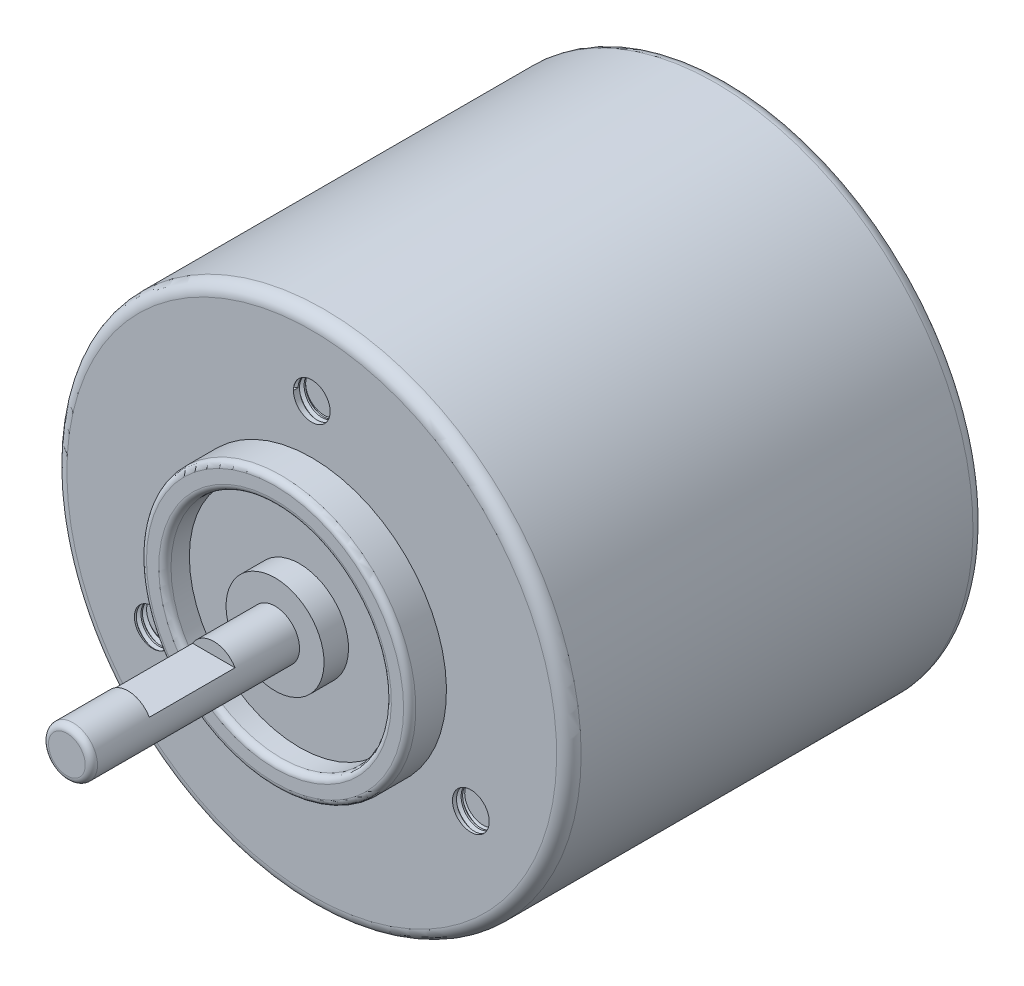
ISO-10303-21;
HEADER;
FILE_DESCRIPTION(('STEP AP214'),'2;1');
FILE_NAME('part.step','',(''),(''),'','','');
FILE_SCHEMA(('AUTOMOTIVE_DESIGN { 1 0 10303 214 1 1 1 1 }'));
ENDSEC;
DATA;
#1=APPLICATION_CONTEXT('core data for automotive mechanical design processes');
#2=APPLICATION_PROTOCOL_DEFINITION('international standard','automotive_design',2000,#1);
#3=PRODUCT_CONTEXT('',#1,'mechanical');
#4=PRODUCT('Part','Part','',(#3));
#5=PRODUCT_RELATED_PRODUCT_CATEGORY('part','',(#4));
#6=PRODUCT_DEFINITION_FORMATION('','',#4);
#7=PRODUCT_DEFINITION_CONTEXT('part definition',#1,'design');
#8=PRODUCT_DEFINITION('design','',#6,#7);
#9=PRODUCT_DEFINITION_SHAPE('','',#8);
#10=(LENGTH_UNIT() NAMED_UNIT(*) SI_UNIT(.MILLI.,.METRE.));
#11=(NAMED_UNIT(*) PLANE_ANGLE_UNIT() SI_UNIT($,.RADIAN.));
#12=(NAMED_UNIT(*) SI_UNIT($,.STERADIAN.) SOLID_ANGLE_UNIT());
#13=UNCERTAINTY_MEASURE_WITH_UNIT(LENGTH_MEASURE(1.E-05),#10,'distance_accuracy_value','');
#14=(GEOMETRIC_REPRESENTATION_CONTEXT(3) GLOBAL_UNCERTAINTY_ASSIGNED_CONTEXT((#13)) GLOBAL_UNIT_ASSIGNED_CONTEXT((#10,
#11,#12)) REPRESENTATION_CONTEXT('',''));
#15=CARTESIAN_POINT('',(0.,0.,0.));
#16=DIRECTION('',(0.,0.,1.));
#17=DIRECTION('',(1.,0.,0.));
#18=AXIS2_PLACEMENT_3D('',#15,#16,#17);
#19=CARTESIAN_POINT('',(0.,15.,33.));
#20=DIRECTION('',(0.,0.,1.));
#21=DIRECTION('',(1.,0.,0.));
#22=AXIS2_PLACEMENT_3D('',#19,#20,#21);
#23=CYLINDRICAL_SURFACE('',#22,1.5);
#24=CARTESIAN_POINT('',(-1.5,15.,34.));
#25=CARTESIAN_POINT('',(-1.5,15.8660254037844,33.9583333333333));
#26=CARTESIAN_POINT('',(-0.75,16.2990381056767,33.9166666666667));
#27=CARTESIAN_POINT('',(0.,16.7320508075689,33.875));
#28=CARTESIAN_POINT('',(0.75,16.2990381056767,33.8333333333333));
#29=CARTESIAN_POINT('',(1.5,15.8660254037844,33.7916666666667));
#30=CARTESIAN_POINT('',(1.5,15.,33.75));
#31=CARTESIAN_POINT('',(1.5,14.1339745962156,33.7083333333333));
#32=CARTESIAN_POINT('',(0.750000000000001,13.7009618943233,33.6666666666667));
#33=CARTESIAN_POINT('',(0.,13.2679491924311,33.625));
#34=CARTESIAN_POINT('',(-0.749999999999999,13.7009618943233,33.5833333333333));
#35=CARTESIAN_POINT('',(-1.5,14.1339745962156,33.5416666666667));
#36=CARTESIAN_POINT('',(-1.5,15.,33.5));
#37=CARTESIAN_POINT('',(-1.5,15.8660254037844,33.4583333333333));
#38=CARTESIAN_POINT('',(-0.75,16.2990381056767,33.4166666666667));
#39=CARTESIAN_POINT('',(0.,16.7320508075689,33.375));
#40=CARTESIAN_POINT('',(0.75,16.2990381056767,33.3333333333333));
#41=CARTESIAN_POINT('',(1.5,15.8660254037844,33.2916666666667));
#42=CARTESIAN_POINT('',(1.5,15.,33.25));
#43=CARTESIAN_POINT('',(1.5,14.1339745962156,33.2083333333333));
#44=CARTESIAN_POINT('',(0.750000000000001,13.7009618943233,33.1666666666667));
#45=CARTESIAN_POINT('',(0.,13.2679491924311,33.125));
#46=CARTESIAN_POINT('',(-0.749999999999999,13.7009618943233,33.0833333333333));
#47=CARTESIAN_POINT('',(-1.5,14.1339745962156,33.0416666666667));
#48=CARTESIAN_POINT('',(-1.5,15.,33.));
#49=(BOUNDED_CURVE() B_SPLINE_CURVE(2,(#24,#25,#26,#27,#28,#29,#30,#31,#32,#33,#34,#35,#36,#37,
#38,#39,#40,#41,#42,#43,#44,#45,#46,#47,#48),.UNSPECIFIED.,.F.,
.F.) B_SPLINE_CURVE_WITH_KNOTS((3,2,2,2,2,2,2,2,2,2,2,2,3),(0.,0.0833333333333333,
0.166666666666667,0.25,0.333333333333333,0.416666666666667,0.5,0.583333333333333,
0.666666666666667,0.75,0.833333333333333,0.916666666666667,1.),
.UNSPECIFIED.) CURVE() GEOMETRIC_REPRESENTATION_ITEM() RATIONAL_B_SPLINE_CURVE((1.,
0.866025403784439,1.,0.866025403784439,1.,0.866025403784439,1.,0.866025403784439,1.,
0.866025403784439,1.,0.866025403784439,1.,0.866025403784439,1.,0.866025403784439,1.,
0.866025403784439,1.,0.866025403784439,1.,0.866025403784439,1.,0.866025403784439,1.)) REPRESENTATION_ITEM(''));
#50=CARTESIAN_POINT('',(-1.5,15.,34.));
#51=VERTEX_POINT('',#50);
#52=CARTESIAN_POINT('',(-1.5,15.,33.));
#53=VERTEX_POINT('',#52);
#54=EDGE_CURVE('E227',#51,#53,#49,.T.);
#55=ORIENTED_EDGE('',*,*,#54,.T.);
#56=CARTESIAN_POINT('',(0.,15.,33.));
#57=DIRECTION('',(0.,0.,1.));
#58=DIRECTION('',(1.,0.,0.));
#59=AXIS2_PLACEMENT_3D('',#56,#57,#58);
#60=CIRCLE('',#59,1.5);
#61=CARTESIAN_POINT('',(2.45806990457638E-08,16.5,33.));
#62=VERTEX_POINT('',#61);
#63=EDGE_CURVE('E211',#62,#53,#60,.T.);
#64=ORIENTED_EDGE('',*,*,#63,.F.);
#65=CARTESIAN_POINT('',(-1.5,15.,33.6250000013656));
#66=CARTESIAN_POINT('',(-1.5,15.8660254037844,33.5833333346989));
#67=CARTESIAN_POINT('',(-0.75,16.2990381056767,33.5416666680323));
#68=CARTESIAN_POINT('',(0.,16.7320508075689,33.5000000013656));
#69=CARTESIAN_POINT('',(0.75,16.2990381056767,33.4583333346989));
#70=CARTESIAN_POINT('',(1.5,15.8660254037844,33.4166666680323));
#71=CARTESIAN_POINT('',(1.5,15.,33.3750000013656));
#72=CARTESIAN_POINT('',(1.5,14.1339745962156,33.3333333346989));
#73=CARTESIAN_POINT('',(0.750000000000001,13.7009618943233,33.2916666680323));
#74=CARTESIAN_POINT('',(0.,13.2679491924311,33.2500000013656));
#75=CARTESIAN_POINT('',(-0.749999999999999,13.7009618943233,33.2083333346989));
#76=CARTESIAN_POINT('',(-1.5,14.1339745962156,33.1666666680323));
#77=CARTESIAN_POINT('',(-1.5,15.,33.1250000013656));
#78=CARTESIAN_POINT('',(-1.5,15.8660254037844,33.0833333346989));
#79=CARTESIAN_POINT('',(-0.75,16.2990381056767,33.0416666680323));
#80=CARTESIAN_POINT('',(0.,16.7320508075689,33.0000000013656));
#81=CARTESIAN_POINT('',(0.75,16.2990381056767,32.9583333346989));
#82=CARTESIAN_POINT('',(1.5,15.8660254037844,32.9166666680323));
#83=CARTESIAN_POINT('',(1.5,15.,32.8750000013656));
#84=CARTESIAN_POINT('',(1.5,14.1339745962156,32.8333333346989));
#85=CARTESIAN_POINT('',(0.750000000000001,13.7009618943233,32.7916666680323));
#86=CARTESIAN_POINT('',(0.,13.2679491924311,32.7500000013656));
#87=CARTESIAN_POINT('',(-0.749999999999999,13.7009618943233,32.7083333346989));
#88=CARTESIAN_POINT('',(-1.5,14.1339745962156,32.6666666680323));
#89=CARTESIAN_POINT('',(-1.5,15.,32.6250000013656));
#90=(BOUNDED_CURVE() B_SPLINE_CURVE(2,(#65,#66,#67,#68,#69,#70,#71,#72,#73,#74,#75,#76,#77,#78,
#79,#80,#81,#82,#83,#84,#85,#86,#87,#88,#89),.UNSPECIFIED.,.F.,
.F.) B_SPLINE_CURVE_WITH_KNOTS((3,2,2,2,2,2,2,2,2,2,2,2,3),(0.,0.0833333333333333,
0.166666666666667,0.25,0.333333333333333,0.416666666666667,0.5,0.583333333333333,
0.666666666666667,0.75,0.833333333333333,0.916666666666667,1.),
.UNSPECIFIED.) CURVE() GEOMETRIC_REPRESENTATION_ITEM() RATIONAL_B_SPLINE_CURVE((1.,
0.866025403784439,1.,0.866025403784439,1.,0.866025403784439,1.,0.866025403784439,1.,
0.866025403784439,1.,0.866025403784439,1.,0.866025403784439,1.,0.866025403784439,1.,
0.866025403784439,1.,0.866025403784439,1.,0.866025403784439,1.,0.866025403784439,1.)) REPRESENTATION_ITEM(''));
#91=CARTESIAN_POINT('',(-1.5,15.,33.6250000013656));
#92=VERTEX_POINT('',#91);
#93=EDGE_CURVE('E262',#92,#62,#90,.T.);
#94=ORIENTED_EDGE('',*,*,#93,.F.);
#95=DIRECTION('',(0.,0.,1.));
#96=VECTOR('',#95,1.);
#97=CARTESIAN_POINT('',(-1.5,15.,33.8125000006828));
#98=LINE('',#97,#96);
#99=EDGE_CURVE('E224',#92,#51,#98,.T.);
#100=ORIENTED_EDGE('',*,*,#99,.T.);
#101=CARTESIAN_POINT('',(0.,15.,34.));
#102=DIRECTION('',(0.,0.,1.));
#103=DIRECTION('',(1.,0.,0.));
#104=AXIS2_PLACEMENT_3D('',#101,#102,#103);
#105=CIRCLE('',#104,1.5);
#106=EDGE_CURVE('E212',#51,#51,#105,.T.);
#107=ORIENTED_EDGE('',*,*,#106,.T.);
#108=EDGE_LOOP('',(#55,#64,#94,#100,#107));
#109=FACE_BOUND('',#108,.T.);
#110=ADVANCED_FACE('F38',(#109),#23,.F.);
#111=CARTESIAN_POINT('',(0.,0.,0.));
#112=DIRECTION('',(0.,0.,-1.));
#113=DIRECTION('',(0.,1.,0.));
#114=AXIS2_PLACEMENT_3D('',#111,#112,#113);
#115=PLANE('',#114);
#116=CARTESIAN_POINT('',(0.,0.,0.));
#117=DIRECTION('',(0.,0.,-1.));
#118=DIRECTION('',(0.,1.,0.));
#119=AXIS2_PLACEMENT_3D('',#116,#117,#118);
#120=CIRCLE('',#119,20.);
#121=CARTESIAN_POINT('',(0.,20.,0.));
#122=VERTEX_POINT('',#121);
#123=EDGE_CURVE('E175',#122,#122,#120,.T.);
#124=ORIENTED_EDGE('',*,*,#123,.T.);
#125=EDGE_LOOP('',(#124));
#126=FACE_BOUND('',#125,.T.);
#127=ADVANCED_FACE('F424',(#126),#115,.T.);
#128=CARTESIAN_POINT('',(0.,0.,0.));
#129=DIRECTION('',(0.,0.,-1.));
#130=DIRECTION('',(0.,1.,0.));
#131=AXIS2_PLACEMENT_3D('',#128,#129,#130);
#132=CYLINDRICAL_SURFACE('',#131,21.);
#133=CARTESIAN_POINT('',(0.,0.,0.999999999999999));
#134=DIRECTION('',(0.,0.,-1.));
#135=DIRECTION('',(0.,1.,0.));
#136=AXIS2_PLACEMENT_3D('',#133,#134,#135);
#137=CIRCLE('',#136,21.);
#138=CARTESIAN_POINT('',(0.,21.,1.));
#139=VERTEX_POINT('',#138);
#140=EDGE_CURVE('E169',#139,#139,#137,.F.);
#141=ORIENTED_EDGE('',*,*,#140,.T.);
#142=EDGE_LOOP('',(#141));
#143=FACE_BOUND('',#142,.T.);
#144=CARTESIAN_POINT('',(0.,0.,33.));
#145=DIRECTION('',(0.,0.,1.));
#146=DIRECTION('',(0.,-1.,0.));
#147=AXIS2_PLACEMENT_3D('',#144,#145,#146);
#148=CIRCLE('',#147,21.);
#149=CARTESIAN_POINT('',(0.,-21.,33.));
#150=VERTEX_POINT('',#149);
#151=EDGE_CURVE('E172',#150,#150,#148,.F.);
#152=ORIENTED_EDGE('',*,*,#151,.T.);
#153=EDGE_LOOP('',(#152));
#154=FACE_BOUND('',#153,.T.);
#155=ADVANCED_FACE('F404',(#143,#154),#132,.T.);
#156=CARTESIAN_POINT('',(0.,21.,34.));
#157=DIRECTION('',(0.,0.,1.));
#158=DIRECTION('',(0.,-1.,0.));
#159=AXIS2_PLACEMENT_3D('',#156,#157,#158);
#160=PLANE('',#159);
#161=CARTESIAN_POINT('',(0.,0.,34.));
#162=DIRECTION('',(0.,0.,1.));
#163=DIRECTION('',(0.,-1.,0.));
#164=AXIS2_PLACEMENT_3D('',#161,#162,#163);
#165=CIRCLE('',#164,20.);
#166=CARTESIAN_POINT('',(0.,-20.,34.));
#167=VERTEX_POINT('',#166);
#168=EDGE_CURVE('E164',#167,#167,#165,.T.);
#169=ORIENTED_EDGE('',*,*,#168,.T.);
#170=EDGE_LOOP('',(#169));
#171=FACE_BOUND('',#170,.T.);
#172=CARTESIAN_POINT('',(12.9903810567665,-7.50000000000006,34.));
#173=DIRECTION('',(0.,0.,1.));
#174=DIRECTION('',(-0.500000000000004,-0.866025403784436,0.));
#175=AXIS2_PLACEMENT_3D('',#172,#173,#174);
#176=CIRCLE('',#175,1.5);
#177=CARTESIAN_POINT('',(13.7403810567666,-6.20096189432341,34.));
#178=VERTEX_POINT('',#177);
#179=EDGE_CURVE('E276',#178,#178,#176,.T.);
#180=ORIENTED_EDGE('',*,*,#179,.F.);
#181=EDGE_LOOP('',(#180));
#182=FACE_BOUND('',#181,.T.);
#183=CARTESIAN_POINT('',(-12.9903810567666,-7.49999999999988,34.));
#184=DIRECTION('',(0.,0.,1.));
#185=DIRECTION('',(-0.499999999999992,0.866025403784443,0.));
#186=AXIS2_PLACEMENT_3D('',#183,#184,#185);
#187=CIRCLE('',#186,1.5);
#188=CARTESIAN_POINT('',(-12.2403810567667,-8.79903810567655,34.));
#189=VERTEX_POINT('',#188);
#190=EDGE_CURVE('E158',#189,#189,#187,.T.);
#191=ORIENTED_EDGE('',*,*,#190,.F.);
#192=EDGE_LOOP('',(#191));
#193=FACE_BOUND('',#192,.T.);
#194=ORIENTED_EDGE('',*,*,#106,.F.);
#195=EDGE_LOOP('',(#194));
#196=FACE_BOUND('',#195,.T.);
#197=CARTESIAN_POINT('',(0.,0.,34.));
#198=DIRECTION('',(0.,0.,-1.));
#199=DIRECTION('',(0.,1.,0.));
#200=AXIS2_PLACEMENT_3D('',#197,#198,#199);
#201=CIRCLE('',#200,11.);
#202=CARTESIAN_POINT('',(0.,11.,34.));
#203=VERTEX_POINT('',#202);
#204=EDGE_CURVE('E196',#203,#203,#201,.T.);
#205=ORIENTED_EDGE('',*,*,#204,.T.);
#206=EDGE_LOOP('',(#205));
#207=FACE_BOUND('',#206,.T.);
#208=ADVANCED_FACE('F400',(#171,#182,#193,#196,#207),#160,.T.);
#209=CARTESIAN_POINT('',(0.,0.,0.));
#210=DIRECTION('',(0.,0.,-1.));
#211=DIRECTION('',(0.,1.,0.));
#212=AXIS2_PLACEMENT_3D('',#209,#210,#211);
#213=CYLINDRICAL_SURFACE('',#212,11.);
#214=CARTESIAN_POINT('',(0.,0.,36.5));
#215=DIRECTION('',(0.,0.,1.));
#216=DIRECTION('',(0.,-1.,0.));
#217=AXIS2_PLACEMENT_3D('',#214,#215,#216);
#218=CIRCLE('',#217,11.);
#219=CARTESIAN_POINT('',(0.,-11.,36.5));
#220=VERTEX_POINT('',#219);
#221=EDGE_CURVE('E193',#220,#220,#218,.F.);
#222=ORIENTED_EDGE('',*,*,#221,.T.);
#223=EDGE_LOOP('',(#222));
#224=FACE_BOUND('',#223,.T.);
#225=ORIENTED_EDGE('',*,*,#204,.F.);
#226=EDGE_LOOP('',(#225));
#227=FACE_BOUND('',#226,.T.);
#228=ADVANCED_FACE('F403',(#224,#227),#213,.T.);
#229=CARTESIAN_POINT('',(0.,11.,37.));
#230=DIRECTION('',(0.,0.,1.));
#231=DIRECTION('',(0.,-1.,0.));
#232=AXIS2_PLACEMENT_3D('',#229,#230,#231);
#233=PLANE('',#232);
#234=CARTESIAN_POINT('',(0.,0.,37.));
#235=DIRECTION('',(0.,0.,1.));
#236=DIRECTION('',(0.,-1.,0.));
#237=AXIS2_PLACEMENT_3D('',#234,#235,#236);
#238=CIRCLE('',#237,10.5);
#239=CARTESIAN_POINT('',(0.,-10.5,37.));
#240=VERTEX_POINT('',#239);
#241=EDGE_CURVE('E187',#240,#240,#238,.T.);
#242=ORIENTED_EDGE('',*,*,#241,.T.);
#243=EDGE_LOOP('',(#242));
#244=FACE_BOUND('',#243,.T.);
#245=CARTESIAN_POINT('',(0.,0.,37.));
#246=DIRECTION('',(0.,0.,1.));
#247=DIRECTION('',(0.,-1.,0.));
#248=AXIS2_PLACEMENT_3D('',#245,#246,#247);
#249=CIRCLE('',#248,9.50000000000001);
#250=CARTESIAN_POINT('',(0.,-9.50000000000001,37.));
#251=VERTEX_POINT('',#250);
#252=EDGE_CURVE('E190',#251,#251,#249,.F.);
#253=ORIENTED_EDGE('',*,*,#252,.T.);
#254=EDGE_LOOP('',(#253));
#255=FACE_BOUND('',#254,.T.);
#256=ADVANCED_FACE('F414',(#244,#255),#233,.T.);
#257=CARTESIAN_POINT('',(0.,0.,0.));
#258=DIRECTION('',(0.,0.,-1.));
#259=DIRECTION('',(0.,1.,0.));
#260=AXIS2_PLACEMENT_3D('',#257,#258,#259);
#261=CYLINDRICAL_SURFACE('',#260,9.00000000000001);
#262=CARTESIAN_POINT('',(0.,0.,36.5));
#263=DIRECTION('',(0.,0.,1.));
#264=DIRECTION('',(0.,-1.,0.));
#265=AXIS2_PLACEMENT_3D('',#262,#263,#264);
#266=CIRCLE('',#265,9.00000000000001);
#267=CARTESIAN_POINT('',(0.,-9.00000000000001,36.5));
#268=VERTEX_POINT('',#267);
#269=EDGE_CURVE('E184',#268,#268,#266,.T.);
#270=ORIENTED_EDGE('',*,*,#269,.T.);
#271=EDGE_LOOP('',(#270));
#272=FACE_BOUND('',#271,.T.);
#273=CARTESIAN_POINT('',(0.,0.,35.));
#274=DIRECTION('',(0.,0.,-1.));
#275=DIRECTION('',(0.,1.,0.));
#276=AXIS2_PLACEMENT_3D('',#273,#274,#275);
#277=CIRCLE('',#276,9.);
#278=CARTESIAN_POINT('',(0.,9.,35.));
#279=VERTEX_POINT('',#278);
#280=EDGE_CURVE('E199',#279,#279,#277,.T.);
#281=ORIENTED_EDGE('',*,*,#280,.T.);
#282=EDGE_LOOP('',(#281));
#283=FACE_BOUND('',#282,.T.);
#284=ADVANCED_FACE('F420',(#272,#283),#261,.F.);
#285=CARTESIAN_POINT('',(0.,9.,35.));
#286=DIRECTION('',(0.,0.,1.));
#287=DIRECTION('',(0.,-1.,0.));
#288=AXIS2_PLACEMENT_3D('',#285,#286,#287);
#289=PLANE('',#288);
#290=CARTESIAN_POINT('',(0.,0.,35.));
#291=DIRECTION('',(0.,0.,-1.));
#292=DIRECTION('',(0.,1.,0.));
#293=AXIS2_PLACEMENT_3D('',#290,#291,#292);
#294=CIRCLE('',#293,4.);
#295=CARTESIAN_POINT('',(0.,4.,35.));
#296=VERTEX_POINT('',#295);
#297=EDGE_CURVE('E202',#296,#296,#294,.T.);
#298=ORIENTED_EDGE('',*,*,#297,.T.);
#299=EDGE_LOOP('',(#298));
#300=FACE_BOUND('',#299,.T.);
#301=ORIENTED_EDGE('',*,*,#280,.F.);
#302=EDGE_LOOP('',(#301));
#303=FACE_BOUND('',#302,.T.);
#304=ADVANCED_FACE('F449',(#300,#303),#289,.T.);
#305=CARTESIAN_POINT('',(0.,0.,0.));
#306=DIRECTION('',(0.,0.,-1.));
#307=DIRECTION('',(0.,1.,0.));
#308=AXIS2_PLACEMENT_3D('',#305,#306,#307);
#309=CYLINDRICAL_SURFACE('',#308,4.);
#310=CARTESIAN_POINT('',(0.,0.,37.));
#311=DIRECTION('',(0.,0.,-1.));
#312=DIRECTION('',(0.,1.,0.));
#313=AXIS2_PLACEMENT_3D('',#310,#311,#312);
#314=CIRCLE('',#313,4.);
#315=CARTESIAN_POINT('',(0.,4.,37.));
#316=VERTEX_POINT('',#315);
#317=EDGE_CURVE('E205',#316,#316,#314,.T.);
#318=ORIENTED_EDGE('',*,*,#317,.T.);
#319=EDGE_LOOP('',(#318));
#320=FACE_BOUND('',#319,.T.);
#321=ORIENTED_EDGE('',*,*,#297,.F.);
#322=EDGE_LOOP('',(#321));
#323=FACE_BOUND('',#322,.T.);
#324=ADVANCED_FACE('F445',(#320,#323),#309,.T.);
#325=CARTESIAN_POINT('',(0.,4.,37.));
#326=DIRECTION('',(0.,0.,1.));
#327=DIRECTION('',(0.,-1.,0.));
#328=AXIS2_PLACEMENT_3D('',#325,#326,#327);
#329=PLANE('',#328);
#330=CARTESIAN_POINT('',(0.,0.,37.));
#331=DIRECTION('',(0.,0.,-1.));
#332=DIRECTION('',(0.,1.,0.));
#333=AXIS2_PLACEMENT_3D('',#330,#331,#332);
#334=CIRCLE('',#333,2.);
#335=CARTESIAN_POINT('',(0.,2.,37.));
#336=VERTEX_POINT('',#335);
#337=EDGE_CURVE('E208',#336,#336,#334,.T.);
#338=ORIENTED_EDGE('',*,*,#337,.T.);
#339=EDGE_LOOP('',(#338));
#340=FACE_BOUND('',#339,.T.);
#341=ORIENTED_EDGE('',*,*,#317,.F.);
#342=EDGE_LOOP('',(#341));
#343=FACE_BOUND('',#342,.T.);
#344=ADVANCED_FACE('F442',(#340,#343),#329,.T.);
#345=CARTESIAN_POINT('',(0.,0.,0.));
#346=DIRECTION('',(0.,0.,-1.));
#347=DIRECTION('',(0.,1.,0.));
#348=AXIS2_PLACEMENT_3D('',#345,#346,#347);
#349=CYLINDRICAL_SURFACE('',#348,2.);
#350=DIRECTION('',(0.,0.,-1.));
#351=VECTOR('',#350,1.);
#352=CARTESIAN_POINT('',(-1.73205080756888,1.,0.));
#353=LINE('',#352,#351);
#354=CARTESIAN_POINT('',(-1.73205080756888,1.,41.9999999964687));
#355=VERTEX_POINT('',#354);
#356=CARTESIAN_POINT('',(-1.73205080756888,1.,49.0000000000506));
#357=VERTEX_POINT('',#356);
#358=EDGE_CURVE('E11',#355,#357,#353,.F.);
#359=ORIENTED_EDGE('',*,*,#358,.F.);
#360=CARTESIAN_POINT('',(0.,0.,41.9999999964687));
#361=DIRECTION('',(0.,0.,1.));
#362=DIRECTION('',(1.,0.,0.));
#363=AXIS2_PLACEMENT_3D('',#360,#361,#362);
#364=CIRCLE('',#363,2.);
#365=CARTESIAN_POINT('',(1.73205080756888,1.,41.9999999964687));
#366=VERTEX_POINT('',#365);
#367=EDGE_CURVE('E46',#355,#366,#364,.F.);
#368=ORIENTED_EDGE('',*,*,#367,.T.);
#369=DIRECTION('',(0.,0.,-1.));
#370=VECTOR('',#369,1.);
#371=CARTESIAN_POINT('',(1.73205080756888,1.,0.));
#372=LINE('',#371,#370);
#373=CARTESIAN_POINT('',(1.73205080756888,0.999999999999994,49.0000000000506));
#374=VERTEX_POINT('',#373);
#375=EDGE_CURVE('E162',#374,#366,#372,.T.);
#376=ORIENTED_EDGE('',*,*,#375,.F.);
#377=CARTESIAN_POINT('',(0.,0.,49.0000000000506));
#378=DIRECTION('',(0.,0.,-1.));
#379=DIRECTION('',(-1.,0.,0.));
#380=AXIS2_PLACEMENT_3D('',#377,#378,#379);
#381=CIRCLE('',#380,2.);
#382=EDGE_CURVE('E156',#374,#357,#381,.F.);
#383=ORIENTED_EDGE('',*,*,#382,.T.);
#384=EDGE_LOOP('',(#359,#368,#376,#383));
#385=FACE_BOUND('',#384,.T.);
#386=CARTESIAN_POINT('',(0.,0.,53.5));
#387=DIRECTION('',(0.,0.,1.));
#388=DIRECTION('',(0.,-1.,0.));
#389=AXIS2_PLACEMENT_3D('',#386,#387,#388);
#390=CIRCLE('',#389,2.);
#391=CARTESIAN_POINT('',(0.,-2.00000000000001,53.5));
#392=VERTEX_POINT('',#391);
#393=EDGE_CURVE('E181',#392,#392,#390,.F.);
#394=ORIENTED_EDGE('',*,*,#393,.T.);
#395=EDGE_LOOP('',(#394));
#396=FACE_BOUND('',#395,.T.);
#397=ORIENTED_EDGE('',*,*,#337,.F.);
#398=EDGE_LOOP('',(#397));
#399=FACE_BOUND('',#398,.T.);
#400=ADVANCED_FACE('F160',(#385,#396,#399),#349,.T.);
#401=CARTESIAN_POINT('',(0.,2.,54.));
#402=DIRECTION('',(0.,0.,1.));
#403=DIRECTION('',(0.,-1.,0.));
#404=AXIS2_PLACEMENT_3D('',#401,#402,#403);
#405=PLANE('',#404);
#406=CARTESIAN_POINT('',(0.,0.,54.));
#407=DIRECTION('',(0.,0.,1.));
#408=DIRECTION('',(0.,-1.,0.));
#409=AXIS2_PLACEMENT_3D('',#406,#407,#408);
#410=CIRCLE('',#409,1.5);
#411=CARTESIAN_POINT('',(0.,-1.50000000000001,54.));
#412=VERTEX_POINT('',#411);
#413=EDGE_CURVE('E178',#412,#412,#410,.T.);
#414=ORIENTED_EDGE('',*,*,#413,.T.);
#415=EDGE_LOOP('',(#414));
#416=FACE_BOUND('',#415,.T.);
#417=ADVANCED_FACE('F436',(#416),#405,.T.);
#418=CARTESIAN_POINT('',(0.,15.,33.));
#419=DIRECTION('',(0.,0.,1.));
#420=DIRECTION('',(1.,0.,0.));
#421=AXIS2_PLACEMENT_3D('',#418,#419,#420);
#422=PLANE('',#421);
#423=ORIENTED_EDGE('',*,*,#63,.T.);
#424=EDGE_CURVE('E215',#53,#62,#60,.T.);
#425=ORIENTED_EDGE('',*,*,#424,.T.);
#426=EDGE_LOOP('',(#423,#425));
#427=FACE_BOUND('',#426,.T.);
#428=ADVANCED_FACE('F434',(#427),#422,.T.);
#429=CARTESIAN_POINT('',(-1.7706329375,15.,33.8125000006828));
#430=DIRECTION('',(0.,-1.,0.));
#431=DIRECTION('',(0.,0.,-1.));
#432=AXIS2_PLACEMENT_3D('',#429,#430,#431);
#433=PLANE('',#432);
#434=DIRECTION('',(0.,0.,-1.));
#435=VECTOR('',#434,1.);
#436=CARTESIAN_POINT('',(-1.7706329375,15.,33.8125000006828));
#437=LINE('',#436,#435);
#438=CARTESIAN_POINT('',(-1.7706329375,15.,33.8437500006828));
#439=VERTEX_POINT('',#438);
#440=CARTESIAN_POINT('',(-1.7706329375,15.,33.7812500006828));
#441=VERTEX_POINT('',#440);
#442=EDGE_CURVE('E238',#439,#441,#437,.T.);
#443=ORIENTED_EDGE('',*,*,#442,.F.);
#444=DIRECTION('',(-0.866025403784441,0.,-0.499999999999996));
#445=VECTOR('',#444,1.);
#446=CARTESIAN_POINT('',(-1.63531646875,15.,33.9218750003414));
#447=LINE('',#446,#445);
#448=EDGE_CURVE('E232',#51,#439,#447,.T.);
#449=ORIENTED_EDGE('',*,*,#448,.F.);
#450=ORIENTED_EDGE('',*,*,#99,.F.);
#451=DIRECTION('',(0.866025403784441,0.,-0.499999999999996));
#452=VECTOR('',#451,1.);
#453=CARTESIAN_POINT('',(-1.63531646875,15.,33.7031250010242));
#454=LINE('',#453,#452);
#455=EDGE_CURVE('E219',#441,#92,#454,.T.);
#456=ORIENTED_EDGE('',*,*,#455,.F.);
#457=EDGE_LOOP('',(#443,#449,#450,#456));
#458=FACE_BOUND('',#457,.T.);
#459=ADVANCED_FACE('F696',(#458),#433,.F.);
#460=CARTESIAN_POINT('',(-1.7706329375,15.,32.8125000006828));
#461=DIRECTION('',(0.,1.,0.));
#462=DIRECTION('',(0.,0.,1.));
#463=AXIS2_PLACEMENT_3D('',#460,#461,#462);
#464=PLANE('',#463);
#465=DIRECTION('',(0.,0.,1.));
#466=VECTOR('',#465,1.);
#467=CARTESIAN_POINT('',(-1.7706329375,15.,32.8125000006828));
#468=LINE('',#467,#466);
#469=CARTESIAN_POINT('',(-1.7706329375,15.,32.7812500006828));
#470=VERTEX_POINT('',#469);
#471=CARTESIAN_POINT('',(-1.7706329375,15.,32.8437500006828));
#472=VERTEX_POINT('',#471);
#473=EDGE_CURVE('E216',#470,#472,#468,.T.);
#474=ORIENTED_EDGE('',*,*,#473,.F.);
#475=DIRECTION('',(-0.866025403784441,0.,0.499999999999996));
#476=VECTOR('',#475,1.);
#477=CARTESIAN_POINT('',(-1.63531646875,15.,32.7031250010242));
#478=LINE('',#477,#476);
#479=CARTESIAN_POINT('',(-1.5,15.,32.6250000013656));
#480=VERTEX_POINT('',#479);
#481=EDGE_CURVE('E221',#480,#470,#478,.T.);
#482=ORIENTED_EDGE('',*,*,#481,.F.);
#483=DIRECTION('',(0.,0.,-1.));
#484=VECTOR('',#483,1.);
#485=CARTESIAN_POINT('',(-1.5,15.,32.8125000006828));
#486=LINE('',#485,#484);
#487=EDGE_CURVE('E229',#53,#480,#486,.T.);
#488=ORIENTED_EDGE('',*,*,#487,.F.);
#489=DIRECTION('',(0.866025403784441,0.,0.499999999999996));
#490=VECTOR('',#489,1.);
#491=CARTESIAN_POINT('',(-1.63531646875,15.,32.9218750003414));
#492=LINE('',#491,#490);
#493=EDGE_CURVE('E235',#472,#53,#492,.T.);
#494=ORIENTED_EDGE('',*,*,#493,.F.);
#495=EDGE_LOOP('',(#474,#482,#488,#494));
#496=FACE_BOUND('',#495,.T.);
#497=ADVANCED_FACE('F694',(#496),#464,.F.);
#498=CARTESIAN_POINT('',(-1.7706329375,15.,33.8437500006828));
#499=CARTESIAN_POINT('',(-1.7706329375,16.0222754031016,33.8020833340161));
#500=CARTESIAN_POINT('',(-0.88531646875,16.5334131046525,33.7604166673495));
#501=CARTESIAN_POINT('',(0.,17.0445508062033,33.7187500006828));
#502=CARTESIAN_POINT('',(0.88531646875,16.5334131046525,33.6770833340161));
#503=CARTESIAN_POINT('',(1.7706329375,16.0222754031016,33.6354166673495));
#504=CARTESIAN_POINT('',(1.7706329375,15.,33.5937500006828));
#505=CARTESIAN_POINT('',(1.7706329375,13.9777245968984,33.5520833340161));
#506=CARTESIAN_POINT('',(0.885316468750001,13.4665868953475,33.5104166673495));
#507=CARTESIAN_POINT('',(0.,12.9554491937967,33.4687500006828));
#508=CARTESIAN_POINT('',(-0.885316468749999,13.4665868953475,33.4270833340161));
#509=CARTESIAN_POINT('',(-1.7706329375,13.9777245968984,33.3854166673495));
#510=CARTESIAN_POINT('',(-1.7706329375,15.,33.3437500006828));
#511=CARTESIAN_POINT('',(-1.7706329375,16.0222754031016,33.3020833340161));
#512=CARTESIAN_POINT('',(-0.88531646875,16.5334131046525,33.2604166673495));
#513=CARTESIAN_POINT('',(0.,17.0445508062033,33.2187500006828));
#514=CARTESIAN_POINT('',(0.88531646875,16.5334131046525,33.1770833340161));
#515=CARTESIAN_POINT('',(1.7706329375,16.0222754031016,33.1354166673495));
#516=CARTESIAN_POINT('',(1.7706329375,15.,33.0937500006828));
#517=CARTESIAN_POINT('',(1.7706329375,13.9777245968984,33.0520833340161));
#518=CARTESIAN_POINT('',(0.885316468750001,13.4665868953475,33.0104166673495));
#519=CARTESIAN_POINT('',(0.,12.9554491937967,32.9687500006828));
#520=CARTESIAN_POINT('',(-0.885316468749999,13.4665868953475,32.9270833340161));
#521=CARTESIAN_POINT('',(-1.7706329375,13.9777245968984,32.8854166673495));
#522=CARTESIAN_POINT('',(-1.7706329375,15.,32.8437500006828));
#523=CARTESIAN_POINT('',(-1.7706329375,15.,33.7812500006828));
#524=CARTESIAN_POINT('',(-1.7706329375,16.0222754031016,33.7395833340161));
#525=CARTESIAN_POINT('',(-0.88531646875,16.5334131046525,33.6979166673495));
#526=CARTESIAN_POINT('',(0.,17.0445508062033,33.6562500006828));
#527=CARTESIAN_POINT('',(0.88531646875,16.5334131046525,33.6145833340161));
#528=CARTESIAN_POINT('',(1.7706329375,16.0222754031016,33.5729166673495));
#529=CARTESIAN_POINT('',(1.7706329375,15.,33.5312500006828));
#530=CARTESIAN_POINT('',(1.7706329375,13.9777245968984,33.4895833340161));
#531=CARTESIAN_POINT('',(0.885316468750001,13.4665868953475,33.4479166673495));
#532=CARTESIAN_POINT('',(0.,12.9554491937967,33.4062500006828));
#533=CARTESIAN_POINT('',(-0.885316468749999,13.4665868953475,33.3645833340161));
#534=CARTESIAN_POINT('',(-1.7706329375,13.9777245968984,33.3229166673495));
#535=CARTESIAN_POINT('',(-1.7706329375,15.,33.2812500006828));
#536=CARTESIAN_POINT('',(-1.7706329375,16.0222754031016,33.2395833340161));
#537=CARTESIAN_POINT('',(-0.88531646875,16.5334131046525,33.1979166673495));
#538=CARTESIAN_POINT('',(0.,17.0445508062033,33.1562500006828));
#539=CARTESIAN_POINT('',(0.88531646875,16.5334131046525,33.1145833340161));
#540=CARTESIAN_POINT('',(1.7706329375,16.0222754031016,33.0729166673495));
#541=CARTESIAN_POINT('',(1.7706329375,15.,33.0312500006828));
#542=CARTESIAN_POINT('',(1.7706329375,13.9777245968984,32.9895833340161));
#543=CARTESIAN_POINT('',(0.885316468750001,13.4665868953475,32.9479166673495));
#544=CARTESIAN_POINT('',(0.,12.9554491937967,32.9062500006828));
#545=CARTESIAN_POINT('',(-0.885316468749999,13.4665868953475,32.8645833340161));
#546=CARTESIAN_POINT('',(-1.7706329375,13.9777245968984,32.8229166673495));
#547=CARTESIAN_POINT('',(-1.7706329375,15.,32.7812500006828));
#548=(BOUNDED_SURFACE() B_SPLINE_SURFACE(1,2,((#498,#499,#500,#501,#502,#503,#504,#505,#506,
#507,#508,#509,#510,#511,#512,#513,#514,#515,#516,#517,#518,#519,#520,#521,#522),(#523,#524,
#525,#526,#527,#528,#529,#530,#531,#532,#533,#534,#535,#536,#537,#538,#539,#540,#541,#542,#543,
#544,#545,#546,#547)),.UNSPECIFIED.,.F.,.F.,.F.) B_SPLINE_SURFACE_WITH_KNOTS((2,2),(3,2,2,2,2,2,
2,2,2,2,2,2,3),(0.,1.),(0.,0.0833333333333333,0.166666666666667,0.25,0.333333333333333,
0.416666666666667,0.5,0.583333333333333,0.666666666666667,0.75,0.833333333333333,
0.916666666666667,1.),
.UNSPECIFIED.) GEOMETRIC_REPRESENTATION_ITEM() RATIONAL_B_SPLINE_SURFACE(((1.,0.866025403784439,
1.,0.866025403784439,1.,0.866025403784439,1.,0.866025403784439,1.,0.866025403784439,1.,
0.866025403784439,1.,0.866025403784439,1.,0.866025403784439,1.,0.866025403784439,1.,
0.866025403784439,1.,0.866025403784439,1.,0.866025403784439,1.),(1.,0.866025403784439,1.,
0.866025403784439,1.,0.866025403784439,1.,0.866025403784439,1.,0.866025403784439,1.,
0.866025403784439,1.,0.866025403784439,1.,0.866025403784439,1.,0.866025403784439,1.,
0.866025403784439,1.,0.866025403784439,1.,0.866025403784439,1.))) REPRESENTATION_ITEM('') SURFACE());
#549=CARTESIAN_POINT('',(-1.7706329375,15.,33.7812500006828));
#550=CARTESIAN_POINT('',(-1.7706329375,16.0222754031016,33.7395833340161));
#551=CARTESIAN_POINT('',(-0.88531646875,16.5334131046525,33.6979166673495));
#552=CARTESIAN_POINT('',(0.,17.0445508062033,33.6562500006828));
#553=CARTESIAN_POINT('',(0.88531646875,16.5334131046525,33.6145833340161));
#554=CARTESIAN_POINT('',(1.7706329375,16.0222754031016,33.5729166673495));
#555=CARTESIAN_POINT('',(1.7706329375,15.,33.5312500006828));
#556=CARTESIAN_POINT('',(1.7706329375,13.9777245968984,33.4895833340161));
#557=CARTESIAN_POINT('',(0.885316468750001,13.4665868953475,33.4479166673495));
#558=CARTESIAN_POINT('',(0.,12.9554491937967,33.4062500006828));
#559=CARTESIAN_POINT('',(-0.885316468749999,13.4665868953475,33.3645833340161));
#560=CARTESIAN_POINT('',(-1.7706329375,13.9777245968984,33.3229166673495));
#561=CARTESIAN_POINT('',(-1.7706329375,15.,33.2812500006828));
#562=CARTESIAN_POINT('',(-1.7706329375,16.0222754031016,33.2395833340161));
#563=CARTESIAN_POINT('',(-0.88531646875,16.5334131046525,33.1979166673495));
#564=CARTESIAN_POINT('',(0.,17.0445508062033,33.1562500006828));
#565=CARTESIAN_POINT('',(0.88531646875,16.5334131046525,33.1145833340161));
#566=CARTESIAN_POINT('',(1.7706329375,16.0222754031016,33.0729166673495));
#567=CARTESIAN_POINT('',(1.7706329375,15.,33.0312500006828));
#568=CARTESIAN_POINT('',(1.7706329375,13.9777245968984,32.9895833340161));
#569=CARTESIAN_POINT('',(0.885316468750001,13.4665868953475,32.9479166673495));
#570=CARTESIAN_POINT('',(0.,12.9554491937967,32.9062500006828));
#571=CARTESIAN_POINT('',(-0.885316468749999,13.4665868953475,32.8645833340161));
#572=CARTESIAN_POINT('',(-1.7706329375,13.9777245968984,32.8229166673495));
#573=CARTESIAN_POINT('',(-1.7706329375,15.,32.7812500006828));
#574=(BOUNDED_CURVE() B_SPLINE_CURVE(2,(#549,#550,#551,#552,#553,#554,#555,#556,#557,#558,#559,
#560,#561,#562,#563,#564,#565,#566,#567,#568,#569,#570,#571,#572,#573),.UNSPECIFIED.,.F.,
.F.) B_SPLINE_CURVE_WITH_KNOTS((3,2,2,2,2,2,2,2,2,2,2,2,3),(0.,0.0833333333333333,
0.166666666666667,0.25,0.333333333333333,0.416666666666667,0.5,0.583333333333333,
0.666666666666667,0.75,0.833333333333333,0.916666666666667,1.),
.UNSPECIFIED.) CURVE() GEOMETRIC_REPRESENTATION_ITEM() RATIONAL_B_SPLINE_CURVE((1.,
0.866025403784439,1.,0.866025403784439,1.,0.866025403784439,1.,0.866025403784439,1.,
0.866025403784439,1.,0.866025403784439,1.,0.866025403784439,1.,0.866025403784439,1.,
0.866025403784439,1.,0.866025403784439,1.,0.866025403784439,1.,0.866025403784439,1.)) REPRESENTATION_ITEM(''));
#575=EDGE_CURVE('E228',#441,#470,#574,.T.);
#576=CARTESIAN_POINT('',(-1.7706329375,15.,33.8437500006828));
#577=CARTESIAN_POINT('',(-1.7706329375,16.0222754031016,33.8020833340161));
#578=CARTESIAN_POINT('',(-0.88531646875,16.5334131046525,33.7604166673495));
#579=CARTESIAN_POINT('',(0.,17.0445508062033,33.7187500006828));
#580=CARTESIAN_POINT('',(0.88531646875,16.5334131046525,33.6770833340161));
#581=CARTESIAN_POINT('',(1.7706329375,16.0222754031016,33.6354166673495));
#582=CARTESIAN_POINT('',(1.7706329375,15.,33.5937500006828));
#583=CARTESIAN_POINT('',(1.7706329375,13.9777245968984,33.5520833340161));
#584=CARTESIAN_POINT('',(0.885316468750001,13.4665868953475,33.5104166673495));
#585=CARTESIAN_POINT('',(0.,12.9554491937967,33.4687500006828));
#586=CARTESIAN_POINT('',(-0.885316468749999,13.4665868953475,33.4270833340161));
#587=CARTESIAN_POINT('',(-1.7706329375,13.9777245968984,33.3854166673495));
#588=CARTESIAN_POINT('',(-1.7706329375,15.,33.3437500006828));
#589=CARTESIAN_POINT('',(-1.7706329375,16.0222754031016,33.3020833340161));
#590=CARTESIAN_POINT('',(-0.88531646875,16.5334131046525,33.2604166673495));
#591=CARTESIAN_POINT('',(0.,17.0445508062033,33.2187500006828));
#592=CARTESIAN_POINT('',(0.88531646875,16.5334131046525,33.1770833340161));
#593=CARTESIAN_POINT('',(1.7706329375,16.0222754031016,33.1354166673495));
#594=CARTESIAN_POINT('',(1.7706329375,15.,33.0937500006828));
#595=CARTESIAN_POINT('',(1.7706329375,13.9777245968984,33.0520833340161));
#596=CARTESIAN_POINT('',(0.885316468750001,13.4665868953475,33.0104166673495));
#597=CARTESIAN_POINT('',(0.,12.9554491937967,32.9687500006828));
#598=CARTESIAN_POINT('',(-0.885316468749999,13.4665868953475,32.9270833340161));
#599=CARTESIAN_POINT('',(-1.7706329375,13.9777245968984,32.8854166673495));
#600=CARTESIAN_POINT('',(-1.7706329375,15.,32.8437500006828));
#601=(BOUNDED_CURVE() B_SPLINE_CURVE(2,(#576,#577,#578,#579,#580,#581,#582,#583,#584,#585,#586,
#587,#588,#589,#590,#591,#592,#593,#594,#595,#596,#597,#598,#599,#600),.UNSPECIFIED.,.F.,
.F.) B_SPLINE_CURVE_WITH_KNOTS((3,2,2,2,2,2,2,2,2,2,2,2,3),(0.,0.0833333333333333,
0.166666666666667,0.25,0.333333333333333,0.416666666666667,0.5,0.583333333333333,
0.666666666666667,0.75,0.833333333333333,0.916666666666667,1.),
.UNSPECIFIED.) CURVE() GEOMETRIC_REPRESENTATION_ITEM() RATIONAL_B_SPLINE_CURVE((1.,
0.866025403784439,1.,0.866025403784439,1.,0.866025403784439,1.,0.866025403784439,1.,
0.866025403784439,1.,0.866025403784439,1.,0.866025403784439,1.,0.866025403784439,1.,
0.866025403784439,1.,0.866025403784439,1.,0.866025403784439,1.,0.866025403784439,1.)) REPRESENTATION_ITEM(''));
#602=EDGE_CURVE('E234',#439,#472,#601,.T.);
#603=ORIENTED_EDGE('',*,*,#442,.T.);
#604=ORIENTED_EDGE('',*,*,#575,.T.);
#605=ORIENTED_EDGE('',*,*,#473,.T.);
#606=ORIENTED_EDGE('',*,*,#602,.F.);
#607=EDGE_LOOP('',(#603,#604,#605,#606));
#608=FACE_BOUND('',#607,.T.);
#609=ADVANCED_FACE('F682',(#608),#548,.T.);
#610=CARTESIAN_POINT('',(-1.5,15.,34.));
#611=CARTESIAN_POINT('',(-1.5,15.8660254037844,33.9583333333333));
#612=CARTESIAN_POINT('',(-0.75,16.2990381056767,33.9166666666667));
#613=CARTESIAN_POINT('',(0.,16.7320508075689,33.875));
#614=CARTESIAN_POINT('',(0.75,16.2990381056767,33.8333333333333));
#615=CARTESIAN_POINT('',(1.5,15.8660254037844,33.7916666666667));
#616=CARTESIAN_POINT('',(1.5,15.,33.75));
#617=CARTESIAN_POINT('',(1.5,14.1339745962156,33.7083333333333));
#618=CARTESIAN_POINT('',(0.750000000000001,13.7009618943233,33.6666666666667));
#619=CARTESIAN_POINT('',(0.,13.2679491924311,33.625));
#620=CARTESIAN_POINT('',(-0.749999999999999,13.7009618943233,33.5833333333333));
#621=CARTESIAN_POINT('',(-1.5,14.1339745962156,33.5416666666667));
#622=CARTESIAN_POINT('',(-1.5,15.,33.5));
#623=CARTESIAN_POINT('',(-1.5,15.8660254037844,33.4583333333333));
#624=CARTESIAN_POINT('',(-0.75,16.2990381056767,33.4166666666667));
#625=CARTESIAN_POINT('',(0.,16.7320508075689,33.375));
#626=CARTESIAN_POINT('',(0.75,16.2990381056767,33.3333333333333));
#627=CARTESIAN_POINT('',(1.5,15.8660254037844,33.2916666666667));
#628=CARTESIAN_POINT('',(1.5,15.,33.25));
#629=CARTESIAN_POINT('',(1.5,14.1339745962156,33.2083333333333));
#630=CARTESIAN_POINT('',(0.750000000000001,13.7009618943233,33.1666666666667));
#631=CARTESIAN_POINT('',(0.,13.2679491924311,33.125));
#632=CARTESIAN_POINT('',(-0.749999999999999,13.7009618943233,33.0833333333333));
#633=CARTESIAN_POINT('',(-1.5,14.1339745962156,33.0416666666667));
#634=CARTESIAN_POINT('',(-1.5,15.,33.));
#635=CARTESIAN_POINT('',(-1.7706329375,15.,33.8437500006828));
#636=CARTESIAN_POINT('',(-1.7706329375,16.0222754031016,33.8020833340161));
#637=CARTESIAN_POINT('',(-0.88531646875,16.5334131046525,33.7604166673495));
#638=CARTESIAN_POINT('',(0.,17.0445508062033,33.7187500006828));
#639=CARTESIAN_POINT('',(0.88531646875,16.5334131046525,33.6770833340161));
#640=CARTESIAN_POINT('',(1.7706329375,16.0222754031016,33.6354166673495));
#641=CARTESIAN_POINT('',(1.7706329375,15.,33.5937500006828));
#642=CARTESIAN_POINT('',(1.7706329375,13.9777245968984,33.5520833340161));
#643=CARTESIAN_POINT('',(0.885316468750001,13.4665868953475,33.5104166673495));
#644=CARTESIAN_POINT('',(0.,12.9554491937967,33.4687500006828));
#645=CARTESIAN_POINT('',(-0.885316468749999,13.4665868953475,33.4270833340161));
#646=CARTESIAN_POINT('',(-1.7706329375,13.9777245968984,33.3854166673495));
#647=CARTESIAN_POINT('',(-1.7706329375,15.,33.3437500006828));
#648=CARTESIAN_POINT('',(-1.7706329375,16.0222754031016,33.3020833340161));
#649=CARTESIAN_POINT('',(-0.88531646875,16.5334131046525,33.2604166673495));
#650=CARTESIAN_POINT('',(0.,17.0445508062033,33.2187500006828));
#651=CARTESIAN_POINT('',(0.88531646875,16.5334131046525,33.1770833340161));
#652=CARTESIAN_POINT('',(1.7706329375,16.0222754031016,33.1354166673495));
#653=CARTESIAN_POINT('',(1.7706329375,15.,33.0937500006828));
#654=CARTESIAN_POINT('',(1.7706329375,13.9777245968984,33.0520833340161));
#655=CARTESIAN_POINT('',(0.885316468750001,13.4665868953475,33.0104166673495));
#656=CARTESIAN_POINT('',(0.,12.9554491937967,32.9687500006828));
#657=CARTESIAN_POINT('',(-0.885316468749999,13.4665868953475,32.9270833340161));
#658=CARTESIAN_POINT('',(-1.7706329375,13.9777245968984,32.8854166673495));
#659=CARTESIAN_POINT('',(-1.7706329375,15.,32.8437500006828));
#660=(BOUNDED_SURFACE() B_SPLINE_SURFACE(1,2,((#610,#611,#612,#613,#614,#615,#616,#617,#618,
#619,#620,#621,#622,#623,#624,#625,#626,#627,#628,#629,#630,#631,#632,#633,#634),(#635,#636,
#637,#638,#639,#640,#641,#642,#643,#644,#645,#646,#647,#648,#649,#650,#651,#652,#653,#654,#655,
#656,#657,#658,#659)),.UNSPECIFIED.,.F.,.F.,.F.) B_SPLINE_SURFACE_WITH_KNOTS((2,2),(3,2,2,2,2,2,
2,2,2,2,2,2,3),(0.,1.),(0.,0.0833333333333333,0.166666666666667,0.25,0.333333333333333,
0.416666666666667,0.5,0.583333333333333,0.666666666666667,0.75,0.833333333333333,
0.916666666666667,1.),
.UNSPECIFIED.) GEOMETRIC_REPRESENTATION_ITEM() RATIONAL_B_SPLINE_SURFACE(((1.,0.866025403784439,
1.,0.866025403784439,1.,0.866025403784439,1.,0.866025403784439,1.,0.866025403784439,1.,
0.866025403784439,1.,0.866025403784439,1.,0.866025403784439,1.,0.866025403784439,1.,
0.866025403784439,1.,0.866025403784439,1.,0.866025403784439,1.),(1.,0.866025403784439,1.,
0.866025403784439,1.,0.866025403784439,1.,0.866025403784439,1.,0.866025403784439,1.,
0.866025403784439,1.,0.866025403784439,1.,0.866025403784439,1.,0.866025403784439,1.,
0.866025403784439,1.,0.866025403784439,1.,0.866025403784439,1.))) REPRESENTATION_ITEM('') SURFACE());
#661=ORIENTED_EDGE('',*,*,#448,.T.);
#662=ORIENTED_EDGE('',*,*,#602,.T.);
#663=ORIENTED_EDGE('',*,*,#493,.T.);
#664=ORIENTED_EDGE('',*,*,#54,.F.);
#665=EDGE_LOOP('',(#661,#662,#663,#664));
#666=FACE_BOUND('',#665,.T.);
#667=ADVANCED_FACE('F671',(#666),#660,.T.);
#668=CARTESIAN_POINT('',(0.,15.,33.));
#669=DIRECTION('',(0.,0.,1.));
#670=DIRECTION('',(1.,0.,0.));
#671=AXIS2_PLACEMENT_3D('',#668,#669,#670);
#672=CYLINDRICAL_SURFACE('',#671,1.5);
#673=ORIENTED_EDGE('',*,*,#487,.T.);
#674=EDGE_CURVE('E223',#62,#480,#90,.T.);
#675=ORIENTED_EDGE('',*,*,#674,.F.);
#676=ORIENTED_EDGE('',*,*,#424,.F.);
#677=EDGE_LOOP('',(#673,#675,#676));
#678=FACE_BOUND('',#677,.T.);
#679=ADVANCED_FACE('F669',(#678),#672,.T.);
#680=CARTESIAN_POINT('',(-1.7706329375,15.,33.7812500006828));
#681=CARTESIAN_POINT('',(-1.7706329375,16.0222754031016,33.7395833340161));
#682=CARTESIAN_POINT('',(-0.88531646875,16.5334131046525,33.6979166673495));
#683=CARTESIAN_POINT('',(0.,17.0445508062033,33.6562500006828));
#684=CARTESIAN_POINT('',(0.88531646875,16.5334131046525,33.6145833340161));
#685=CARTESIAN_POINT('',(1.7706329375,16.0222754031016,33.5729166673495));
#686=CARTESIAN_POINT('',(1.7706329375,15.,33.5312500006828));
#687=CARTESIAN_POINT('',(1.7706329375,13.9777245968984,33.4895833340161));
#688=CARTESIAN_POINT('',(0.885316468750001,13.4665868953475,33.4479166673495));
#689=CARTESIAN_POINT('',(0.,12.9554491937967,33.4062500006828));
#690=CARTESIAN_POINT('',(-0.885316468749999,13.4665868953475,33.3645833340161));
#691=CARTESIAN_POINT('',(-1.7706329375,13.9777245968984,33.3229166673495));
#692=CARTESIAN_POINT('',(-1.7706329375,15.,33.2812500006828));
#693=CARTESIAN_POINT('',(-1.7706329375,16.0222754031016,33.2395833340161));
#694=CARTESIAN_POINT('',(-0.88531646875,16.5334131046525,33.1979166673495));
#695=CARTESIAN_POINT('',(0.,17.0445508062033,33.1562500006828));
#696=CARTESIAN_POINT('',(0.88531646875,16.5334131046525,33.1145833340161));
#697=CARTESIAN_POINT('',(1.7706329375,16.0222754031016,33.0729166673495));
#698=CARTESIAN_POINT('',(1.7706329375,15.,33.0312500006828));
#699=CARTESIAN_POINT('',(1.7706329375,13.9777245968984,32.9895833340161));
#700=CARTESIAN_POINT('',(0.885316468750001,13.4665868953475,32.9479166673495));
#701=CARTESIAN_POINT('',(0.,12.9554491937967,32.9062500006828));
#702=CARTESIAN_POINT('',(-0.885316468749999,13.4665868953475,32.8645833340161));
#703=CARTESIAN_POINT('',(-1.7706329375,13.9777245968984,32.8229166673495));
#704=CARTESIAN_POINT('',(-1.7706329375,15.,32.7812500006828));
#705=CARTESIAN_POINT('',(-1.5,15.,33.6250000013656));
#706=CARTESIAN_POINT('',(-1.5,15.8660254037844,33.5833333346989));
#707=CARTESIAN_POINT('',(-0.75,16.2990381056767,33.5416666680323));
#708=CARTESIAN_POINT('',(0.,16.7320508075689,33.5000000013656));
#709=CARTESIAN_POINT('',(0.75,16.2990381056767,33.4583333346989));
#710=CARTESIAN_POINT('',(1.5,15.8660254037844,33.4166666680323));
#711=CARTESIAN_POINT('',(1.5,15.,33.3750000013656));
#712=CARTESIAN_POINT('',(1.5,14.1339745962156,33.3333333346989));
#713=CARTESIAN_POINT('',(0.750000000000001,13.7009618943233,33.2916666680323));
#714=CARTESIAN_POINT('',(0.,13.2679491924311,33.2500000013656));
#715=CARTESIAN_POINT('',(-0.749999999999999,13.7009618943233,33.2083333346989));
#716=CARTESIAN_POINT('',(-1.5,14.1339745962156,33.1666666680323));
#717=CARTESIAN_POINT('',(-1.5,15.,33.1250000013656));
#718=CARTESIAN_POINT('',(-1.5,15.8660254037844,33.0833333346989));
#719=CARTESIAN_POINT('',(-0.75,16.2990381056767,33.0416666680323));
#720=CARTESIAN_POINT('',(0.,16.7320508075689,33.0000000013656));
#721=CARTESIAN_POINT('',(0.75,16.2990381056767,32.9583333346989));
#722=CARTESIAN_POINT('',(1.5,15.8660254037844,32.9166666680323));
#723=CARTESIAN_POINT('',(1.5,15.,32.8750000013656));
#724=CARTESIAN_POINT('',(1.5,14.1339745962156,32.8333333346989));
#725=CARTESIAN_POINT('',(0.750000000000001,13.7009618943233,32.7916666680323));
#726=CARTESIAN_POINT('',(0.,13.2679491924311,32.7500000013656));
#727=CARTESIAN_POINT('',(-0.749999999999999,13.7009618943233,32.7083333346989));
#728=CARTESIAN_POINT('',(-1.5,14.1339745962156,32.6666666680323));
#729=CARTESIAN_POINT('',(-1.5,15.,32.6250000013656));
#730=(BOUNDED_SURFACE() B_SPLINE_SURFACE(1,2,((#680,#681,#682,#683,#684,#685,#686,#687,#688,
#689,#690,#691,#692,#693,#694,#695,#696,#697,#698,#699,#700,#701,#702,#703,#704),(#705,#706,
#707,#708,#709,#710,#711,#712,#713,#714,#715,#716,#717,#718,#719,#720,#721,#722,#723,#724,#725,
#726,#727,#728,#729)),.UNSPECIFIED.,.F.,.F.,.F.) B_SPLINE_SURFACE_WITH_KNOTS((2,2),(3,2,2,2,2,2,
2,2,2,2,2,2,3),(0.,1.),(0.,0.0833333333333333,0.166666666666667,0.25,0.333333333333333,
0.416666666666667,0.5,0.583333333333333,0.666666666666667,0.75,0.833333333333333,
0.916666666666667,1.),
.UNSPECIFIED.) GEOMETRIC_REPRESENTATION_ITEM() RATIONAL_B_SPLINE_SURFACE(((1.,0.866025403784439,
1.,0.866025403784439,1.,0.866025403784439,1.,0.866025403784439,1.,0.866025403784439,1.,
0.866025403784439,1.,0.866025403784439,1.,0.866025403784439,1.,0.866025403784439,1.,
0.866025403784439,1.,0.866025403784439,1.,0.866025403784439,1.),(1.,0.866025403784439,1.,
0.866025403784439,1.,0.866025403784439,1.,0.866025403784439,1.,0.866025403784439,1.,
0.866025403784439,1.,0.866025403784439,1.,0.866025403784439,1.,0.866025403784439,1.,
0.866025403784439,1.,0.866025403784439,1.,0.866025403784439,1.))) REPRESENTATION_ITEM('') SURFACE());
#731=ORIENTED_EDGE('',*,*,#455,.T.);
#732=ORIENTED_EDGE('',*,*,#93,.T.);
#733=ORIENTED_EDGE('',*,*,#674,.T.);
#734=ORIENTED_EDGE('',*,*,#481,.T.);
#735=ORIENTED_EDGE('',*,*,#575,.F.);
#736=EDGE_LOOP('',(#731,#732,#733,#734,#735));
#737=FACE_BOUND('',#736,.T.);
#738=ADVANCED_FACE('F663',(#737),#730,.T.);
#739=CARTESIAN_POINT('',(-12.9903810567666,-7.49999999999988,33.));
#740=DIRECTION('',(0.,0.,1.));
#741=DIRECTION('',(-0.499999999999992,0.866025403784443,0.));
#742=AXIS2_PLACEMENT_3D('',#739,#740,#741);
#743=PLANE('',#742);
#744=CARTESIAN_POINT('',(-12.9903810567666,-7.49999999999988,33.));
#745=DIRECTION('',(0.,0.,1.));
#746=DIRECTION('',(-0.499999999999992,0.866025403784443,0.));
#747=AXIS2_PLACEMENT_3D('',#744,#745,#746);
#748=CIRCLE('',#747,1.5);
#749=CARTESIAN_POINT('',(-14.2894191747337,-8.24999997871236,33.));
#750=VERTEX_POINT('',#749);
#751=CARTESIAN_POINT('',(-12.2403810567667,-8.79903810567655,33.));
#752=VERTEX_POINT('',#751);
#753=EDGE_CURVE('E277',#750,#752,#748,.T.);
#754=ORIENTED_EDGE('',*,*,#753,.T.);
#755=EDGE_CURVE('E306',#752,#750,#748,.T.);
#756=ORIENTED_EDGE('',*,*,#755,.T.);
#757=EDGE_LOOP('',(#754,#756));
#758=FACE_BOUND('',#757,.T.);
#759=ADVANCED_FACE('F659',(#758),#743,.T.);
#760=CARTESIAN_POINT('',(-12.1050645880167,-9.03341310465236,33.8125000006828));
#761=DIRECTION('',(0.866025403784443,0.499999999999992,0.));
#762=DIRECTION('',(0.,0.,-1.));
#763=AXIS2_PLACEMENT_3D('',#760,#761,#762);
#764=PLANE('',#763);
#765=DIRECTION('',(0.,0.,-1.));
#766=VECTOR('',#765,1.);
#767=CARTESIAN_POINT('',(-12.1050645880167,-9.03341310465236,33.8125000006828));
#768=LINE('',#767,#766);
#769=CARTESIAN_POINT('',(-12.1050645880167,-9.03341310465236,33.8437500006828));
#770=VERTEX_POINT('',#769);
#771=CARTESIAN_POINT('',(-12.1050645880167,-9.03341310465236,33.7812500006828));
#772=VERTEX_POINT('',#771);
#773=EDGE_CURVE('E281',#770,#772,#768,.T.);
#774=ORIENTED_EDGE('',*,*,#773,.F.);
#775=DIRECTION('',(0.433012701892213,-0.750000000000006,-0.499999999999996));
#776=VECTOR('',#775,1.);
#777=CARTESIAN_POINT('',(-12.1727228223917,-8.91622560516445,33.9218750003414));
#778=LINE('',#777,#776);
#779=EDGE_CURVE('E300',#189,#770,#778,.T.);
#780=ORIENTED_EDGE('',*,*,#779,.F.);
#781=DIRECTION('',(0.,0.,1.));
#782=VECTOR('',#781,1.);
#783=CARTESIAN_POINT('',(-12.2403810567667,-8.79903810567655,33.8125000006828));
#784=LINE('',#783,#782);
#785=CARTESIAN_POINT('',(-12.2403810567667,-8.79903810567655,33.6250000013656));
#786=VERTEX_POINT('',#785);
#787=EDGE_CURVE('E270',#786,#189,#784,.T.);
#788=ORIENTED_EDGE('',*,*,#787,.F.);
#789=DIRECTION('',(-0.433012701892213,0.750000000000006,-0.499999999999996));
#790=VECTOR('',#789,1.);
#791=CARTESIAN_POINT('',(-12.1727228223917,-8.91622560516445,33.7031250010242));
#792=LINE('',#791,#790);
#793=EDGE_CURVE('E328',#772,#786,#792,.T.);
#794=ORIENTED_EDGE('',*,*,#793,.F.);
#795=EDGE_LOOP('',(#774,#780,#788,#794));
#796=FACE_BOUND('',#795,.T.);
#797=ADVANCED_FACE('F655',(#796),#764,.F.);
#798=CARTESIAN_POINT('',(-12.9903810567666,-7.49999999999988,33.));
#799=DIRECTION('',(0.,0.,1.));
#800=DIRECTION('',(-0.499999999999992,0.866025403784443,0.));
#801=AXIS2_PLACEMENT_3D('',#798,#799,#800);
#802=CYLINDRICAL_SURFACE('',#801,1.5);
#803=CARTESIAN_POINT('',(-12.2403810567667,-8.79903810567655,34.));
#804=CARTESIAN_POINT('',(-12.9903810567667,-9.23205080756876,33.9583333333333));
#805=CARTESIAN_POINT('',(-13.7403810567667,-8.79903810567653,33.9166666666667));
#806=CARTESIAN_POINT('',(-14.4903810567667,-8.36602540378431,33.875));
#807=CARTESIAN_POINT('',(-14.4903810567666,-7.49999999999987,33.8333333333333));
#808=CARTESIAN_POINT('',(-14.4903810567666,-6.63397459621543,33.7916666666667));
#809=CARTESIAN_POINT('',(-13.7403810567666,-6.20096189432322,33.75));
#810=CARTESIAN_POINT('',(-12.9903810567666,-5.76794919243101,33.7083333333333));
#811=CARTESIAN_POINT('',(-12.2403810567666,-6.20096189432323,33.6666666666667));
#812=CARTESIAN_POINT('',(-11.4903810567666,-6.63397459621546,33.625));
#813=CARTESIAN_POINT('',(-11.4903810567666,-7.4999999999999,33.5833333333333));
#814=CARTESIAN_POINT('',(-11.4903810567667,-8.36602540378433,33.5416666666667));
#815=CARTESIAN_POINT('',(-12.2403810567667,-8.79903810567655,33.5));
#816=CARTESIAN_POINT('',(-12.9903810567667,-9.23205080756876,33.4583333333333));
#817=CARTESIAN_POINT('',(-13.7403810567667,-8.79903810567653,33.4166666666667));
#818=CARTESIAN_POINT('',(-14.4903810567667,-8.36602540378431,33.375));
#819=CARTESIAN_POINT('',(-14.4903810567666,-7.49999999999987,33.3333333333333));
#820=CARTESIAN_POINT('',(-14.4903810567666,-6.63397459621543,33.2916666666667));
#821=CARTESIAN_POINT('',(-13.7403810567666,-6.20096189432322,33.25));
#822=CARTESIAN_POINT('',(-12.9903810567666,-5.76794919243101,33.2083333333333));
#823=CARTESIAN_POINT('',(-12.2403810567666,-6.20096189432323,33.1666666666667));
#824=CARTESIAN_POINT('',(-11.4903810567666,-6.63397459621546,33.125));
#825=CARTESIAN_POINT('',(-11.4903810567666,-7.4999999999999,33.0833333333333));
#826=CARTESIAN_POINT('',(-11.4903810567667,-8.36602540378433,33.0416666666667));
#827=CARTESIAN_POINT('',(-12.2403810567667,-8.79903810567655,33.));
#828=(BOUNDED_CURVE() B_SPLINE_CURVE(2,(#803,#804,#805,#806,#807,#808,#809,#810,#811,#812,#813,
#814,#815,#816,#817,#818,#819,#820,#821,#822,#823,#824,#825,#826,#827),.UNSPECIFIED.,.F.,
.F.) B_SPLINE_CURVE_WITH_KNOTS((3,2,2,2,2,2,2,2,2,2,2,2,3),(0.,0.0833333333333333,
0.166666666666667,0.25,0.333333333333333,0.416666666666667,0.5,0.583333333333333,
0.666666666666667,0.75,0.833333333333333,0.916666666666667,1.),
.UNSPECIFIED.) CURVE() GEOMETRIC_REPRESENTATION_ITEM() RATIONAL_B_SPLINE_CURVE((1.,
0.866025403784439,1.,0.866025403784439,1.,0.866025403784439,1.,0.866025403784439,1.,
0.866025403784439,1.,0.866025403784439,1.,0.866025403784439,1.,0.866025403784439,1.,
0.866025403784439,1.,0.866025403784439,1.,0.866025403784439,1.,0.866025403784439,1.)) REPRESENTATION_ITEM(''));
#829=EDGE_CURVE('E284',#189,#752,#828,.T.);
#830=ORIENTED_EDGE('',*,*,#829,.T.);
#831=ORIENTED_EDGE('',*,*,#753,.F.);
#832=CARTESIAN_POINT('',(-12.2403810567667,-8.79903810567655,33.6250000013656));
#833=CARTESIAN_POINT('',(-12.9903810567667,-9.23205080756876,33.5833333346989));
#834=CARTESIAN_POINT('',(-13.7403810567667,-8.79903810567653,33.5416666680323));
#835=CARTESIAN_POINT('',(-14.4903810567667,-8.36602540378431,33.5000000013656));
#836=CARTESIAN_POINT('',(-14.4903810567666,-7.49999999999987,33.4583333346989));
#837=CARTESIAN_POINT('',(-14.4903810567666,-6.63397459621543,33.4166666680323));
#838=CARTESIAN_POINT('',(-13.7403810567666,-6.20096189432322,33.3750000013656));
#839=CARTESIAN_POINT('',(-12.9903810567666,-5.76794919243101,33.3333333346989));
#840=CARTESIAN_POINT('',(-12.2403810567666,-6.20096189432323,33.2916666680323));
#841=CARTESIAN_POINT('',(-11.4903810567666,-6.63397459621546,33.2500000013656));
#842=CARTESIAN_POINT('',(-11.4903810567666,-7.4999999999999,33.2083333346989));
#843=CARTESIAN_POINT('',(-11.4903810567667,-8.36602540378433,33.1666666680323));
#844=CARTESIAN_POINT('',(-12.2403810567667,-8.79903810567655,33.1250000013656));
#845=CARTESIAN_POINT('',(-12.9903810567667,-9.23205080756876,33.0833333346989));
#846=CARTESIAN_POINT('',(-13.7403810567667,-8.79903810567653,33.0416666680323));
#847=CARTESIAN_POINT('',(-14.4903810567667,-8.36602540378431,33.0000000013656));
#848=CARTESIAN_POINT('',(-14.4903810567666,-7.49999999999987,32.9583333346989));
#849=CARTESIAN_POINT('',(-14.4903810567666,-6.63397459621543,32.9166666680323));
#850=CARTESIAN_POINT('',(-13.7403810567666,-6.20096189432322,32.8750000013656));
#851=CARTESIAN_POINT('',(-12.9903810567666,-5.76794919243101,32.8333333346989));
#852=CARTESIAN_POINT('',(-12.2403810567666,-6.20096189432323,32.7916666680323));
#853=CARTESIAN_POINT('',(-11.4903810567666,-6.63397459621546,32.7500000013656));
#854=CARTESIAN_POINT('',(-11.4903810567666,-7.4999999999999,32.7083333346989));
#855=CARTESIAN_POINT('',(-11.4903810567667,-8.36602540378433,32.6666666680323));
#856=CARTESIAN_POINT('',(-12.2403810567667,-8.79903810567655,32.6250000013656));
#857=(BOUNDED_CURVE() B_SPLINE_CURVE(2,(#832,#833,#834,#835,#836,#837,#838,#839,#840,#841,#842,
#843,#844,#845,#846,#847,#848,#849,#850,#851,#852,#853,#854,#855,#856),.UNSPECIFIED.,.F.,
.F.) B_SPLINE_CURVE_WITH_KNOTS((3,2,2,2,2,2,2,2,2,2,2,2,3),(0.,0.0833333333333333,
0.166666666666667,0.25,0.333333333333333,0.416666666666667,0.5,0.583333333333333,
0.666666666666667,0.75,0.833333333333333,0.916666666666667,1.),
.UNSPECIFIED.) CURVE() GEOMETRIC_REPRESENTATION_ITEM() RATIONAL_B_SPLINE_CURVE((1.,
0.866025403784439,1.,0.866025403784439,1.,0.866025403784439,1.,0.866025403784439,1.,
0.866025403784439,1.,0.866025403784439,1.,0.866025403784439,1.,0.866025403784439,1.,
0.866025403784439,1.,0.866025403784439,1.,0.866025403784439,1.,0.866025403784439,1.)) REPRESENTATION_ITEM(''));
#858=EDGE_CURVE('E324',#786,#750,#857,.T.);
#859=ORIENTED_EDGE('',*,*,#858,.F.);
#860=ORIENTED_EDGE('',*,*,#787,.T.);
#861=ORIENTED_EDGE('',*,*,#190,.T.);
#862=EDGE_LOOP('',(#830,#831,#859,#860,#861));
#863=FACE_BOUND('',#862,.T.);
#864=ADVANCED_FACE('F651',(#863),#802,.F.);
#865=CARTESIAN_POINT('',(-12.1050645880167,-9.03341310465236,32.8125000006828));
#866=DIRECTION('',(-0.866025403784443,-0.499999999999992,0.));
#867=DIRECTION('',(0.,0.,1.));
#868=AXIS2_PLACEMENT_3D('',#865,#866,#867);
#869=PLANE('',#868);
#870=DIRECTION('',(0.,0.,1.));
#871=VECTOR('',#870,1.);
#872=CARTESIAN_POINT('',(-12.1050645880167,-9.03341310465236,32.8125000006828));
#873=LINE('',#872,#871);
#874=CARTESIAN_POINT('',(-12.1050645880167,-9.03341310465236,32.7812500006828));
#875=VERTEX_POINT('',#874);
#876=CARTESIAN_POINT('',(-12.1050645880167,-9.03341310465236,32.8437500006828));
#877=VERTEX_POINT('',#876);
#878=EDGE_CURVE('E278',#875,#877,#873,.T.);
#879=ORIENTED_EDGE('',*,*,#878,.F.);
#880=DIRECTION('',(0.433012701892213,-0.750000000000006,0.499999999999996));
#881=VECTOR('',#880,1.);
#882=CARTESIAN_POINT('',(-12.1727228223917,-8.91622560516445,32.7031250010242));
#883=LINE('',#882,#881);
#884=CARTESIAN_POINT('',(-12.2403810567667,-8.79903810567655,32.6250000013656));
#885=VERTEX_POINT('',#884);
#886=EDGE_CURVE('E317',#885,#875,#883,.T.);
#887=ORIENTED_EDGE('',*,*,#886,.F.);
#888=DIRECTION('',(0.,0.,-1.));
#889=VECTOR('',#888,1.);
#890=CARTESIAN_POINT('',(-12.2403810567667,-8.79903810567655,32.8125000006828));
#891=LINE('',#890,#889);
#892=EDGE_CURVE('E309',#752,#885,#891,.T.);
#893=ORIENTED_EDGE('',*,*,#892,.F.);
#894=DIRECTION('',(-0.433012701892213,0.750000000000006,0.499999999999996));
#895=VECTOR('',#894,1.);
#896=CARTESIAN_POINT('',(-12.1727228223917,-8.91622560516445,32.9218750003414));
#897=LINE('',#896,#895);
#898=EDGE_CURVE('E289',#877,#752,#897,.T.);
#899=ORIENTED_EDGE('',*,*,#898,.F.);
#900=EDGE_LOOP('',(#879,#887,#893,#899));
#901=FACE_BOUND('',#900,.T.);
#902=ADVANCED_FACE('F641',(#901),#869,.F.);
#903=CARTESIAN_POINT('',(-12.1050645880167,-9.03341310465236,33.8437500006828));
#904=CARTESIAN_POINT('',(-12.9903810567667,-9.54455080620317,33.8020833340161));
#905=CARTESIAN_POINT('',(-13.8756975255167,-9.03341310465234,33.7604166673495));
#906=CARTESIAN_POINT('',(-14.7610139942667,-8.52227540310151,33.7187500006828));
#907=CARTESIAN_POINT('',(-14.7610139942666,-7.49999999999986,33.6770833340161));
#908=CARTESIAN_POINT('',(-14.7610139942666,-6.47772459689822,33.6354166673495));
#909=CARTESIAN_POINT('',(-13.8756975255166,-5.96658689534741,33.5937500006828));
#910=CARTESIAN_POINT('',(-12.9903810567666,-5.4554491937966,33.5520833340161));
#911=CARTESIAN_POINT('',(-12.1050645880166,-5.96658689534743,33.5104166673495));
#912=CARTESIAN_POINT('',(-11.2197481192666,-6.47772459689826,33.4687500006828));
#913=CARTESIAN_POINT('',(-11.2197481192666,-7.4999999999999,33.4270833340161));
#914=CARTESIAN_POINT('',(-11.2197481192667,-8.52227540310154,33.3854166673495));
#915=CARTESIAN_POINT('',(-12.1050645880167,-9.03341310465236,33.3437500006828));
#916=CARTESIAN_POINT('',(-12.9903810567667,-9.54455080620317,33.3020833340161));
#917=CARTESIAN_POINT('',(-13.8756975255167,-9.03341310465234,33.2604166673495));
#918=CARTESIAN_POINT('',(-14.7610139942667,-8.52227540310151,33.2187500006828));
#919=CARTESIAN_POINT('',(-14.7610139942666,-7.49999999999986,33.1770833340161));
#920=CARTESIAN_POINT('',(-14.7610139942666,-6.47772459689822,33.1354166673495));
#921=CARTESIAN_POINT('',(-13.8756975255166,-5.96658689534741,33.0937500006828));
#922=CARTESIAN_POINT('',(-12.9903810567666,-5.4554491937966,33.0520833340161));
#923=CARTESIAN_POINT('',(-12.1050645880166,-5.96658689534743,33.0104166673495));
#924=CARTESIAN_POINT('',(-11.2197481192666,-6.47772459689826,32.9687500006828));
#925=CARTESIAN_POINT('',(-11.2197481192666,-7.4999999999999,32.9270833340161));
#926=CARTESIAN_POINT('',(-11.2197481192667,-8.52227540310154,32.8854166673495));
#927=CARTESIAN_POINT('',(-12.1050645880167,-9.03341310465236,32.8437500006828));
#928=CARTESIAN_POINT('',(-12.1050645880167,-9.03341310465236,33.7812500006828));
#929=CARTESIAN_POINT('',(-12.9903810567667,-9.54455080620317,33.7395833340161));
#930=CARTESIAN_POINT('',(-13.8756975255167,-9.03341310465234,33.6979166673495));
#931=CARTESIAN_POINT('',(-14.7610139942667,-8.52227540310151,33.6562500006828));
#932=CARTESIAN_POINT('',(-14.7610139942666,-7.49999999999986,33.6145833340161));
#933=CARTESIAN_POINT('',(-14.7610139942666,-6.47772459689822,33.5729166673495));
#934=CARTESIAN_POINT('',(-13.8756975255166,-5.96658689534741,33.5312500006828));
#935=CARTESIAN_POINT('',(-12.9903810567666,-5.4554491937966,33.4895833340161));
#936=CARTESIAN_POINT('',(-12.1050645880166,-5.96658689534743,33.4479166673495));
#937=CARTESIAN_POINT('',(-11.2197481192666,-6.47772459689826,33.4062500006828));
#938=CARTESIAN_POINT('',(-11.2197481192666,-7.4999999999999,33.3645833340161));
#939=CARTESIAN_POINT('',(-11.2197481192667,-8.52227540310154,33.3229166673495));
#940=CARTESIAN_POINT('',(-12.1050645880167,-9.03341310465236,33.2812500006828));
#941=CARTESIAN_POINT('',(-12.9903810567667,-9.54455080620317,33.2395833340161));
#942=CARTESIAN_POINT('',(-13.8756975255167,-9.03341310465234,33.1979166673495));
#943=CARTESIAN_POINT('',(-14.7610139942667,-8.52227540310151,33.1562500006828));
#944=CARTESIAN_POINT('',(-14.7610139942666,-7.49999999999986,33.1145833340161));
#945=CARTESIAN_POINT('',(-14.7610139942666,-6.47772459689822,33.0729166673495));
#946=CARTESIAN_POINT('',(-13.8756975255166,-5.96658689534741,33.0312500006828));
#947=CARTESIAN_POINT('',(-12.9903810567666,-5.4554491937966,32.9895833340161));
#948=CARTESIAN_POINT('',(-12.1050645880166,-5.96658689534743,32.9479166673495));
#949=CARTESIAN_POINT('',(-11.2197481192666,-6.47772459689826,32.9062500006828));
#950=CARTESIAN_POINT('',(-11.2197481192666,-7.4999999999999,32.8645833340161));
#951=CARTESIAN_POINT('',(-11.2197481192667,-8.52227540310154,32.8229166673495));
#952=CARTESIAN_POINT('',(-12.1050645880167,-9.03341310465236,32.7812500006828));
#953=(BOUNDED_SURFACE() B_SPLINE_SURFACE(1,2,((#903,#904,#905,#906,#907,#908,#909,#910,#911,
#912,#913,#914,#915,#916,#917,#918,#919,#920,#921,#922,#923,#924,#925,#926,#927),(#928,#929,
#930,#931,#932,#933,#934,#935,#936,#937,#938,#939,#940,#941,#942,#943,#944,#945,#946,#947,#948,
#949,#950,#951,#952)),.UNSPECIFIED.,.F.,.F.,.F.) B_SPLINE_SURFACE_WITH_KNOTS((2,2),(3,2,2,2,2,2,
2,2,2,2,2,2,3),(0.,1.),(0.,0.0833333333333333,0.166666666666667,0.25,0.333333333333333,
0.416666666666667,0.5,0.583333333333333,0.666666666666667,0.75,0.833333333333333,
0.916666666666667,1.),
.UNSPECIFIED.) GEOMETRIC_REPRESENTATION_ITEM() RATIONAL_B_SPLINE_SURFACE(((1.,0.866025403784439,
1.,0.866025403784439,1.,0.866025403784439,1.,0.866025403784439,1.,0.866025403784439,1.,
0.866025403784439,1.,0.866025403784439,1.,0.866025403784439,1.,0.866025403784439,1.,
0.866025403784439,1.,0.866025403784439,1.,0.866025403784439,1.),(1.,0.866025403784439,1.,
0.866025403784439,1.,0.866025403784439,1.,0.866025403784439,1.,0.866025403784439,1.,
0.866025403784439,1.,0.866025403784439,1.,0.866025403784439,1.,0.866025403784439,1.,
0.866025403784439,1.,0.866025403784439,1.,0.866025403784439,1.))) REPRESENTATION_ITEM('') SURFACE());
#954=CARTESIAN_POINT('',(-12.1050645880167,-9.03341310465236,33.7812500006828));
#955=CARTESIAN_POINT('',(-12.9903810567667,-9.54455080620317,33.7395833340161));
#956=CARTESIAN_POINT('',(-13.8756975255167,-9.03341310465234,33.6979166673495));
#957=CARTESIAN_POINT('',(-14.7610139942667,-8.52227540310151,33.6562500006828));
#958=CARTESIAN_POINT('',(-14.7610139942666,-7.49999999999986,33.6145833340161));
#959=CARTESIAN_POINT('',(-14.7610139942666,-6.47772459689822,33.5729166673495));
#960=CARTESIAN_POINT('',(-13.8756975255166,-5.96658689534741,33.5312500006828));
#961=CARTESIAN_POINT('',(-12.9903810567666,-5.4554491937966,33.4895833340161));
#962=CARTESIAN_POINT('',(-12.1050645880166,-5.96658689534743,33.4479166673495));
#963=CARTESIAN_POINT('',(-11.2197481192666,-6.47772459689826,33.4062500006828));
#964=CARTESIAN_POINT('',(-11.2197481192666,-7.4999999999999,33.3645833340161));
#965=CARTESIAN_POINT('',(-11.2197481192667,-8.52227540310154,33.3229166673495));
#966=CARTESIAN_POINT('',(-12.1050645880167,-9.03341310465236,33.2812500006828));
#967=CARTESIAN_POINT('',(-12.9903810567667,-9.54455080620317,33.2395833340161));
#968=CARTESIAN_POINT('',(-13.8756975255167,-9.03341310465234,33.1979166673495));
#969=CARTESIAN_POINT('',(-14.7610139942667,-8.52227540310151,33.1562500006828));
#970=CARTESIAN_POINT('',(-14.7610139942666,-7.49999999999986,33.1145833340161));
#971=CARTESIAN_POINT('',(-14.7610139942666,-6.47772459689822,33.0729166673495));
#972=CARTESIAN_POINT('',(-13.8756975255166,-5.96658689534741,33.0312500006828));
#973=CARTESIAN_POINT('',(-12.9903810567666,-5.4554491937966,32.9895833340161));
#974=CARTESIAN_POINT('',(-12.1050645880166,-5.96658689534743,32.9479166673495));
#975=CARTESIAN_POINT('',(-11.2197481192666,-6.47772459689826,32.9062500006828));
#976=CARTESIAN_POINT('',(-11.2197481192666,-7.4999999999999,32.8645833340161));
#977=CARTESIAN_POINT('',(-11.2197481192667,-8.52227540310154,32.8229166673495));
#978=CARTESIAN_POINT('',(-12.1050645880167,-9.03341310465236,32.7812500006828));
#979=(BOUNDED_CURVE() B_SPLINE_CURVE(2,(#954,#955,#956,#957,#958,#959,#960,#961,#962,#963,#964,
#965,#966,#967,#968,#969,#970,#971,#972,#973,#974,#975,#976,#977,#978),.UNSPECIFIED.,.F.,
.F.) B_SPLINE_CURVE_WITH_KNOTS((3,2,2,2,2,2,2,2,2,2,2,2,3),(0.,0.0833333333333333,
0.166666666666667,0.25,0.333333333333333,0.416666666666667,0.5,0.583333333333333,
0.666666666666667,0.75,0.833333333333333,0.916666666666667,1.),
.UNSPECIFIED.) CURVE() GEOMETRIC_REPRESENTATION_ITEM() RATIONAL_B_SPLINE_CURVE((1.,
0.866025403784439,1.,0.866025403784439,1.,0.866025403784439,1.,0.866025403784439,1.,
0.866025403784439,1.,0.866025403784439,1.,0.866025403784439,1.,0.866025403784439,1.,
0.866025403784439,1.,0.866025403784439,1.,0.866025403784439,1.,0.866025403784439,1.)) REPRESENTATION_ITEM(''));
#980=EDGE_CURVE('E312',#772,#875,#979,.T.);
#981=CARTESIAN_POINT('',(-12.1050645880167,-9.03341310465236,33.8437500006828));
#982=CARTESIAN_POINT('',(-12.9903810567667,-9.54455080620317,33.8020833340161));
#983=CARTESIAN_POINT('',(-13.8756975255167,-9.03341310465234,33.7604166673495));
#984=CARTESIAN_POINT('',(-14.7610139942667,-8.52227540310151,33.7187500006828));
#985=CARTESIAN_POINT('',(-14.7610139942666,-7.49999999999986,33.6770833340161));
#986=CARTESIAN_POINT('',(-14.7610139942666,-6.47772459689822,33.6354166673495));
#987=CARTESIAN_POINT('',(-13.8756975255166,-5.96658689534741,33.5937500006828));
#988=CARTESIAN_POINT('',(-12.9903810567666,-5.4554491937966,33.5520833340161));
#989=CARTESIAN_POINT('',(-12.1050645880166,-5.96658689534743,33.5104166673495));
#990=CARTESIAN_POINT('',(-11.2197481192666,-6.47772459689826,33.4687500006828));
#991=CARTESIAN_POINT('',(-11.2197481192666,-7.4999999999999,33.4270833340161));
#992=CARTESIAN_POINT('',(-11.2197481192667,-8.52227540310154,33.3854166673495));
#993=CARTESIAN_POINT('',(-12.1050645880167,-9.03341310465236,33.3437500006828));
#994=CARTESIAN_POINT('',(-12.9903810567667,-9.54455080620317,33.3020833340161));
#995=CARTESIAN_POINT('',(-13.8756975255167,-9.03341310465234,33.2604166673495));
#996=CARTESIAN_POINT('',(-14.7610139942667,-8.52227540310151,33.2187500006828));
#997=CARTESIAN_POINT('',(-14.7610139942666,-7.49999999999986,33.1770833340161));
#998=CARTESIAN_POINT('',(-14.7610139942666,-6.47772459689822,33.1354166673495));
#999=CARTESIAN_POINT('',(-13.8756975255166,-5.96658689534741,33.0937500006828));
#1000=CARTESIAN_POINT('',(-12.9903810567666,-5.4554491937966,33.0520833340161));
#1001=CARTESIAN_POINT('',(-12.1050645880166,-5.96658689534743,33.0104166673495));
#1002=CARTESIAN_POINT('',(-11.2197481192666,-6.47772459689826,32.9687500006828));
#1003=CARTESIAN_POINT('',(-11.2197481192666,-7.4999999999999,32.9270833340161));
#1004=CARTESIAN_POINT('',(-11.2197481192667,-8.52227540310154,32.8854166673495));
#1005=CARTESIAN_POINT('',(-12.1050645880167,-9.03341310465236,32.8437500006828));
#1006=(BOUNDED_CURVE() B_SPLINE_CURVE(2,(#981,#982,#983,#984,#985,#986,#987,#988,#989,#990,#991,
#992,#993,#994,#995,#996,#997,#998,#999,#1000,#1001,#1002,#1003,#1004,#1005),.UNSPECIFIED.,.F.,
.F.) B_SPLINE_CURVE_WITH_KNOTS((3,2,2,2,2,2,2,2,2,2,2,2,3),(0.,0.0833333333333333,
0.166666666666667,0.25,0.333333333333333,0.416666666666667,0.5,0.583333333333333,
0.666666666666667,0.75,0.833333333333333,0.916666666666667,1.),
.UNSPECIFIED.) CURVE() GEOMETRIC_REPRESENTATION_ITEM() RATIONAL_B_SPLINE_CURVE((1.,
0.866025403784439,1.,0.866025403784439,1.,0.866025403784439,1.,0.866025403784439,1.,
0.866025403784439,1.,0.866025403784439,1.,0.866025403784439,1.,0.866025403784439,1.,
0.866025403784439,1.,0.866025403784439,1.,0.866025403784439,1.,0.866025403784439,1.)) REPRESENTATION_ITEM(''));
#1007=EDGE_CURVE('E296',#770,#877,#1006,.T.);
#1008=ORIENTED_EDGE('',*,*,#773,.T.);
#1009=ORIENTED_EDGE('',*,*,#980,.T.);
#1010=ORIENTED_EDGE('',*,*,#878,.T.);
#1011=ORIENTED_EDGE('',*,*,#1007,.F.);
#1012=EDGE_LOOP('',(#1008,#1009,#1010,#1011));
#1013=FACE_BOUND('',#1012,.T.);
#1014=ADVANCED_FACE('F629',(#1013),#953,.T.);
#1015=CARTESIAN_POINT('',(-12.2403810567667,-8.79903810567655,34.));
#1016=CARTESIAN_POINT('',(-12.9903810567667,-9.23205080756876,33.9583333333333));
#1017=CARTESIAN_POINT('',(-13.7403810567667,-8.79903810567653,33.9166666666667));
#1018=CARTESIAN_POINT('',(-14.4903810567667,-8.36602540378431,33.875));
#1019=CARTESIAN_POINT('',(-14.4903810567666,-7.49999999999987,33.8333333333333));
#1020=CARTESIAN_POINT('',(-14.4903810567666,-6.63397459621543,33.7916666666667));
#1021=CARTESIAN_POINT('',(-13.7403810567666,-6.20096189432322,33.75));
#1022=CARTESIAN_POINT('',(-12.9903810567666,-5.76794919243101,33.7083333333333));
#1023=CARTESIAN_POINT('',(-12.2403810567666,-6.20096189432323,33.6666666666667));
#1024=CARTESIAN_POINT('',(-11.4903810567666,-6.63397459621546,33.625));
#1025=CARTESIAN_POINT('',(-11.4903810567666,-7.4999999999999,33.5833333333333));
#1026=CARTESIAN_POINT('',(-11.4903810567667,-8.36602540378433,33.5416666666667));
#1027=CARTESIAN_POINT('',(-12.2403810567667,-8.79903810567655,33.5));
#1028=CARTESIAN_POINT('',(-12.9903810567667,-9.23205080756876,33.4583333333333));
#1029=CARTESIAN_POINT('',(-13.7403810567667,-8.79903810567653,33.4166666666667));
#1030=CARTESIAN_POINT('',(-14.4903810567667,-8.36602540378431,33.375));
#1031=CARTESIAN_POINT('',(-14.4903810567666,-7.49999999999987,33.3333333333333));
#1032=CARTESIAN_POINT('',(-14.4903810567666,-6.63397459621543,33.2916666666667));
#1033=CARTESIAN_POINT('',(-13.7403810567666,-6.20096189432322,33.25));
#1034=CARTESIAN_POINT('',(-12.9903810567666,-5.76794919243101,33.2083333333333));
#1035=CARTESIAN_POINT('',(-12.2403810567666,-6.20096189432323,33.1666666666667));
#1036=CARTESIAN_POINT('',(-11.4903810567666,-6.63397459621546,33.125));
#1037=CARTESIAN_POINT('',(-11.4903810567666,-7.4999999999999,33.0833333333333));
#1038=CARTESIAN_POINT('',(-11.4903810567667,-8.36602540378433,33.0416666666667));
#1039=CARTESIAN_POINT('',(-12.2403810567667,-8.79903810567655,33.));
#1040=CARTESIAN_POINT('',(-12.1050645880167,-9.03341310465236,33.8437500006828));
#1041=CARTESIAN_POINT('',(-12.9903810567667,-9.54455080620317,33.8020833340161));
#1042=CARTESIAN_POINT('',(-13.8756975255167,-9.03341310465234,33.7604166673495));
#1043=CARTESIAN_POINT('',(-14.7610139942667,-8.52227540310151,33.7187500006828));
#1044=CARTESIAN_POINT('',(-14.7610139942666,-7.49999999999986,33.6770833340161));
#1045=CARTESIAN_POINT('',(-14.7610139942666,-6.47772459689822,33.6354166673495));
#1046=CARTESIAN_POINT('',(-13.8756975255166,-5.96658689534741,33.5937500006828));
#1047=CARTESIAN_POINT('',(-12.9903810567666,-5.4554491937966,33.5520833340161));
#1048=CARTESIAN_POINT('',(-12.1050645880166,-5.96658689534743,33.5104166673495));
#1049=CARTESIAN_POINT('',(-11.2197481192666,-6.47772459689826,33.4687500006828));
#1050=CARTESIAN_POINT('',(-11.2197481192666,-7.4999999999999,33.4270833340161));
#1051=CARTESIAN_POINT('',(-11.2197481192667,-8.52227540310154,33.3854166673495));
#1052=CARTESIAN_POINT('',(-12.1050645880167,-9.03341310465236,33.3437500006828));
#1053=CARTESIAN_POINT('',(-12.9903810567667,-9.54455080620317,33.3020833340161));
#1054=CARTESIAN_POINT('',(-13.8756975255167,-9.03341310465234,33.2604166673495));
#1055=CARTESIAN_POINT('',(-14.7610139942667,-8.52227540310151,33.2187500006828));
#1056=CARTESIAN_POINT('',(-14.7610139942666,-7.49999999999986,33.1770833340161));
#1057=CARTESIAN_POINT('',(-14.7610139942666,-6.47772459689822,33.1354166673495));
#1058=CARTESIAN_POINT('',(-13.8756975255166,-5.96658689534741,33.0937500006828));
#1059=CARTESIAN_POINT('',(-12.9903810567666,-5.4554491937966,33.0520833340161));
#1060=CARTESIAN_POINT('',(-12.1050645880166,-5.96658689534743,33.0104166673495));
#1061=CARTESIAN_POINT('',(-11.2197481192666,-6.47772459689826,32.9687500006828));
#1062=CARTESIAN_POINT('',(-11.2197481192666,-7.4999999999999,32.9270833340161));
#1063=CARTESIAN_POINT('',(-11.2197481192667,-8.52227540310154,32.8854166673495));
#1064=CARTESIAN_POINT('',(-12.1050645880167,-9.03341310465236,32.8437500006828));
#1065=(BOUNDED_SURFACE() B_SPLINE_SURFACE(1,2,((#1015,#1016,#1017,#1018,#1019,#1020,#1021,#1022,
#1023,#1024,#1025,#1026,#1027,#1028,#1029,#1030,#1031,#1032,#1033,#1034,#1035,#1036,#1037,#1038,
#1039),(#1040,#1041,#1042,#1043,#1044,#1045,#1046,#1047,#1048,#1049,#1050,#1051,#1052,#1053,
#1054,#1055,#1056,#1057,#1058,#1059,#1060,#1061,#1062,#1063,#1064)),.UNSPECIFIED.,.F.,.F.,
.F.) B_SPLINE_SURFACE_WITH_KNOTS((2,2),(3,2,2,2,2,2,2,2,2,2,2,2,3),(0.,1.),(0.,
0.0833333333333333,0.166666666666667,0.25,0.333333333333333,0.416666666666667,0.5,
0.583333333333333,0.666666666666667,0.75,0.833333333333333,0.916666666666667,1.),
.UNSPECIFIED.) GEOMETRIC_REPRESENTATION_ITEM() RATIONAL_B_SPLINE_SURFACE(((1.,0.866025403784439,
1.,0.866025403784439,1.,0.866025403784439,1.,0.866025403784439,1.,0.866025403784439,1.,
0.866025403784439,1.,0.866025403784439,1.,0.866025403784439,1.,0.866025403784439,1.,
0.866025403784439,1.,0.866025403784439,1.,0.866025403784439,1.),(1.,0.866025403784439,1.,
0.866025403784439,1.,0.866025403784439,1.,0.866025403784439,1.,0.866025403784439,1.,
0.866025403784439,1.,0.866025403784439,1.,0.866025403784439,1.,0.866025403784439,1.,
0.866025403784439,1.,0.866025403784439,1.,0.866025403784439,1.))) REPRESENTATION_ITEM('') SURFACE());
#1066=ORIENTED_EDGE('',*,*,#779,.T.);
#1067=ORIENTED_EDGE('',*,*,#1007,.T.);
#1068=ORIENTED_EDGE('',*,*,#898,.T.);
#1069=ORIENTED_EDGE('',*,*,#829,.F.);
#1070=EDGE_LOOP('',(#1066,#1067,#1068,#1069));
#1071=FACE_BOUND('',#1070,.T.);
#1072=ADVANCED_FACE('F623',(#1071),#1065,.T.);
#1073=CARTESIAN_POINT('',(-12.9903810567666,-7.49999999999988,33.));
#1074=DIRECTION('',(0.,0.,1.));
#1075=DIRECTION('',(-0.499999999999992,0.866025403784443,0.));
#1076=AXIS2_PLACEMENT_3D('',#1073,#1074,#1075);
#1077=CYLINDRICAL_SURFACE('',#1076,1.5);
#1078=ORIENTED_EDGE('',*,*,#892,.T.);
#1079=EDGE_CURVE('E323',#750,#885,#857,.T.);
#1080=ORIENTED_EDGE('',*,*,#1079,.F.);
#1081=ORIENTED_EDGE('',*,*,#755,.F.);
#1082=EDGE_LOOP('',(#1078,#1080,#1081));
#1083=FACE_BOUND('',#1082,.T.);
#1084=ADVANCED_FACE('F613',(#1083),#1077,.T.);
#1085=CARTESIAN_POINT('',(-12.1050645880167,-9.03341310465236,33.7812500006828));
#1086=CARTESIAN_POINT('',(-12.9903810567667,-9.54455080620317,33.7395833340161));
#1087=CARTESIAN_POINT('',(-13.8756975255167,-9.03341310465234,33.6979166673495));
#1088=CARTESIAN_POINT('',(-14.7610139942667,-8.52227540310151,33.6562500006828));
#1089=CARTESIAN_POINT('',(-14.7610139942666,-7.49999999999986,33.6145833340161));
#1090=CARTESIAN_POINT('',(-14.7610139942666,-6.47772459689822,33.5729166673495));
#1091=CARTESIAN_POINT('',(-13.8756975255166,-5.96658689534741,33.5312500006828));
#1092=CARTESIAN_POINT('',(-12.9903810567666,-5.4554491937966,33.4895833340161));
#1093=CARTESIAN_POINT('',(-12.1050645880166,-5.96658689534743,33.4479166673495));
#1094=CARTESIAN_POINT('',(-11.2197481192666,-6.47772459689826,33.4062500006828));
#1095=CARTESIAN_POINT('',(-11.2197481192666,-7.4999999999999,33.3645833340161));
#1096=CARTESIAN_POINT('',(-11.2197481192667,-8.52227540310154,33.3229166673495));
#1097=CARTESIAN_POINT('',(-12.1050645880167,-9.03341310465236,33.2812500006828));
#1098=CARTESIAN_POINT('',(-12.9903810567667,-9.54455080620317,33.2395833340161));
#1099=CARTESIAN_POINT('',(-13.8756975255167,-9.03341310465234,33.1979166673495));
#1100=CARTESIAN_POINT('',(-14.7610139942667,-8.52227540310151,33.1562500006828));
#1101=CARTESIAN_POINT('',(-14.7610139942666,-7.49999999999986,33.1145833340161));
#1102=CARTESIAN_POINT('',(-14.7610139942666,-6.47772459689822,33.0729166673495));
#1103=CARTESIAN_POINT('',(-13.8756975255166,-5.96658689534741,33.0312500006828));
#1104=CARTESIAN_POINT('',(-12.9903810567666,-5.4554491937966,32.9895833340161));
#1105=CARTESIAN_POINT('',(-12.1050645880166,-5.96658689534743,32.9479166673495));
#1106=CARTESIAN_POINT('',(-11.2197481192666,-6.47772459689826,32.9062500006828));
#1107=CARTESIAN_POINT('',(-11.2197481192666,-7.4999999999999,32.8645833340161));
#1108=CARTESIAN_POINT('',(-11.2197481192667,-8.52227540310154,32.8229166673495));
#1109=CARTESIAN_POINT('',(-12.1050645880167,-9.03341310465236,32.7812500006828));
#1110=CARTESIAN_POINT('',(-12.2403810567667,-8.79903810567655,33.6250000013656));
#1111=CARTESIAN_POINT('',(-12.9903810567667,-9.23205080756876,33.5833333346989));
#1112=CARTESIAN_POINT('',(-13.7403810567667,-8.79903810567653,33.5416666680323));
#1113=CARTESIAN_POINT('',(-14.4903810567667,-8.36602540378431,33.5000000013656));
#1114=CARTESIAN_POINT('',(-14.4903810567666,-7.49999999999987,33.4583333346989));
#1115=CARTESIAN_POINT('',(-14.4903810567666,-6.63397459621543,33.4166666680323));
#1116=CARTESIAN_POINT('',(-13.7403810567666,-6.20096189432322,33.3750000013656));
#1117=CARTESIAN_POINT('',(-12.9903810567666,-5.76794919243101,33.3333333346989));
#1118=CARTESIAN_POINT('',(-12.2403810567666,-6.20096189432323,33.2916666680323));
#1119=CARTESIAN_POINT('',(-11.4903810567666,-6.63397459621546,33.2500000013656));
#1120=CARTESIAN_POINT('',(-11.4903810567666,-7.4999999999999,33.2083333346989));
#1121=CARTESIAN_POINT('',(-11.4903810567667,-8.36602540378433,33.1666666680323));
#1122=CARTESIAN_POINT('',(-12.2403810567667,-8.79903810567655,33.1250000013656));
#1123=CARTESIAN_POINT('',(-12.9903810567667,-9.23205080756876,33.0833333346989));
#1124=CARTESIAN_POINT('',(-13.7403810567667,-8.79903810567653,33.0416666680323));
#1125=CARTESIAN_POINT('',(-14.4903810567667,-8.36602540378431,33.0000000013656));
#1126=CARTESIAN_POINT('',(-14.4903810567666,-7.49999999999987,32.9583333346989));
#1127=CARTESIAN_POINT('',(-14.4903810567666,-6.63397459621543,32.9166666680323));
#1128=CARTESIAN_POINT('',(-13.7403810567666,-6.20096189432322,32.8750000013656));
#1129=CARTESIAN_POINT('',(-12.9903810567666,-5.76794919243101,32.8333333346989));
#1130=CARTESIAN_POINT('',(-12.2403810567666,-6.20096189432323,32.7916666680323));
#1131=CARTESIAN_POINT('',(-11.4903810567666,-6.63397459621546,32.7500000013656));
#1132=CARTESIAN_POINT('',(-11.4903810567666,-7.4999999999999,32.7083333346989));
#1133=CARTESIAN_POINT('',(-11.4903810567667,-8.36602540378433,32.6666666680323));
#1134=CARTESIAN_POINT('',(-12.2403810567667,-8.79903810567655,32.6250000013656));
#1135=(BOUNDED_SURFACE() B_SPLINE_SURFACE(1,2,((#1085,#1086,#1087,#1088,#1089,#1090,#1091,#1092,
#1093,#1094,#1095,#1096,#1097,#1098,#1099,#1100,#1101,#1102,#1103,#1104,#1105,#1106,#1107,#1108,
#1109),(#1110,#1111,#1112,#1113,#1114,#1115,#1116,#1117,#1118,#1119,#1120,#1121,#1122,#1123,
#1124,#1125,#1126,#1127,#1128,#1129,#1130,#1131,#1132,#1133,#1134)),.UNSPECIFIED.,.F.,.F.,
.F.) B_SPLINE_SURFACE_WITH_KNOTS((2,2),(3,2,2,2,2,2,2,2,2,2,2,2,3),(0.,1.),(0.,
0.0833333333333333,0.166666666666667,0.25,0.333333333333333,0.416666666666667,0.5,
0.583333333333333,0.666666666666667,0.75,0.833333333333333,0.916666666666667,1.),
.UNSPECIFIED.) GEOMETRIC_REPRESENTATION_ITEM() RATIONAL_B_SPLINE_SURFACE(((1.,0.866025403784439,
1.,0.866025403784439,1.,0.866025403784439,1.,0.866025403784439,1.,0.866025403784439,1.,
0.866025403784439,1.,0.866025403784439,1.,0.866025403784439,1.,0.866025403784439,1.,
0.866025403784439,1.,0.866025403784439,1.,0.866025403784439,1.),(1.,0.866025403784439,1.,
0.866025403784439,1.,0.866025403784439,1.,0.866025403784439,1.,0.866025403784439,1.,
0.866025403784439,1.,0.866025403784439,1.,0.866025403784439,1.,0.866025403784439,1.,
0.866025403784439,1.,0.866025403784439,1.,0.866025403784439,1.))) REPRESENTATION_ITEM('') SURFACE());
#1136=ORIENTED_EDGE('',*,*,#793,.T.);
#1137=ORIENTED_EDGE('',*,*,#858,.T.);
#1138=ORIENTED_EDGE('',*,*,#1079,.T.);
#1139=ORIENTED_EDGE('',*,*,#886,.T.);
#1140=ORIENTED_EDGE('',*,*,#980,.F.);
#1141=EDGE_LOOP('',(#1136,#1137,#1138,#1139,#1140));
#1142=FACE_BOUND('',#1141,.T.);
#1143=ADVANCED_FACE('F607',(#1142),#1135,.T.);
#1144=CARTESIAN_POINT('',(12.9903810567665,-7.50000000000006,33.));
#1145=DIRECTION('',(0.,0.,1.));
#1146=DIRECTION('',(-0.500000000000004,-0.866025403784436,0.));
#1147=AXIS2_PLACEMENT_3D('',#1144,#1145,#1146);
#1148=PLANE('',#1147);
#1149=CARTESIAN_POINT('',(12.9903810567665,-7.50000000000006,33.));
#1150=DIRECTION('',(0.,0.,1.));
#1151=DIRECTION('',(-0.500000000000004,-0.866025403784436,0.));
#1152=AXIS2_PLACEMENT_3D('',#1149,#1150,#1151);
#1153=CIRCLE('',#1152,1.5);
#1154=CARTESIAN_POINT('',(14.2894191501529,-8.25000002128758,33.));
#1155=VERTEX_POINT('',#1154);
#1156=CARTESIAN_POINT('',(13.7403810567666,-6.20096189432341,33.));
#1157=VERTEX_POINT('',#1156);
#1158=EDGE_CURVE('E337',#1155,#1157,#1153,.T.);
#1159=ORIENTED_EDGE('',*,*,#1158,.T.);
#1160=EDGE_CURVE('E366',#1157,#1155,#1153,.T.);
#1161=ORIENTED_EDGE('',*,*,#1160,.T.);
#1162=EDGE_LOOP('',(#1159,#1161));
#1163=FACE_BOUND('',#1162,.T.);
#1164=ADVANCED_FACE('F603',(#1163),#1148,.T.);
#1165=CARTESIAN_POINT('',(13.8756975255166,-5.9665868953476,33.8125000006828));
#1166=DIRECTION('',(-0.866025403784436,0.500000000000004,0.));
#1167=DIRECTION('',(0.,0.,-1.));
#1168=AXIS2_PLACEMENT_3D('',#1165,#1166,#1167);
#1169=PLANE('',#1168);
#1170=DIRECTION('',(0.,0.,-1.));
#1171=VECTOR('',#1170,1.);
#1172=CARTESIAN_POINT('',(13.8756975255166,-5.9665868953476,33.8125000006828));
#1173=LINE('',#1172,#1171);
#1174=CARTESIAN_POINT('',(13.8756975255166,-5.9665868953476,33.8437500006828));
#1175=VERTEX_POINT('',#1174);
#1176=CARTESIAN_POINT('',(13.8756975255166,-5.9665868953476,33.7812500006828));
#1177=VERTEX_POINT('',#1176);
#1178=EDGE_CURVE('E341',#1175,#1177,#1173,.T.);
#1179=ORIENTED_EDGE('',*,*,#1178,.F.);
#1180=DIRECTION('',(0.433012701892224,0.75,-0.499999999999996));
#1181=VECTOR('',#1180,1.);
#1182=CARTESIAN_POINT('',(13.8080392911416,-6.08377439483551,33.9218750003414));
#1183=LINE('',#1182,#1181);
#1184=EDGE_CURVE('E360',#178,#1175,#1183,.T.);
#1185=ORIENTED_EDGE('',*,*,#1184,.F.);
#1186=DIRECTION('',(0.,0.,1.));
#1187=VECTOR('',#1186,1.);
#1188=CARTESIAN_POINT('',(13.7403810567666,-6.20096189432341,33.8125000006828));
#1189=LINE('',#1188,#1187);
#1190=CARTESIAN_POINT('',(13.7403810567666,-6.20096189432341,33.6250000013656));
#1191=VERTEX_POINT('',#1190);
#1192=EDGE_CURVE('E60',#1191,#178,#1189,.T.);
#1193=ORIENTED_EDGE('',*,*,#1192,.F.);
#1194=DIRECTION('',(-0.433012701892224,-0.75,-0.499999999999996));
#1195=VECTOR('',#1194,1.);
#1196=CARTESIAN_POINT('',(13.8080392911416,-6.08377439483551,33.7031250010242));
#1197=LINE('',#1196,#1195);
#1198=EDGE_CURVE('E388',#1177,#1191,#1197,.T.);
#1199=ORIENTED_EDGE('',*,*,#1198,.F.);
#1200=EDGE_LOOP('',(#1179,#1185,#1193,#1199));
#1201=FACE_BOUND('',#1200,.T.);
#1202=ADVANCED_FACE('F600',(#1201),#1169,.F.);
#1203=CARTESIAN_POINT('',(12.9903810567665,-7.50000000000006,33.));
#1204=DIRECTION('',(0.,0.,1.));
#1205=DIRECTION('',(-0.500000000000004,-0.866025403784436,0.));
#1206=AXIS2_PLACEMENT_3D('',#1203,#1204,#1205);
#1207=CYLINDRICAL_SURFACE('',#1206,1.5);
#1208=CARTESIAN_POINT('',(13.7403810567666,-6.20096189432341,34.));
#1209=CARTESIAN_POINT('',(14.4903810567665,-6.63397459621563,33.9583333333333));
#1210=CARTESIAN_POINT('',(14.4903810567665,-7.50000000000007,33.9166666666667));
#1211=CARTESIAN_POINT('',(14.4903810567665,-8.36602540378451,33.875));
#1212=CARTESIAN_POINT('',(13.7403810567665,-8.79903810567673,33.8333333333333));
#1213=CARTESIAN_POINT('',(12.9903810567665,-9.23205080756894,33.7916666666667));
#1214=CARTESIAN_POINT('',(12.2403810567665,-8.79903810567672,33.75));
#1215=CARTESIAN_POINT('',(11.4903810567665,-8.3660254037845,33.7083333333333));
#1216=CARTESIAN_POINT('',(11.4903810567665,-7.50000000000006,33.6666666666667));
#1217=CARTESIAN_POINT('',(11.4903810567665,-6.63397459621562,33.625));
#1218=CARTESIAN_POINT('',(12.2403810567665,-6.2009618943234,33.5833333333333));
#1219=CARTESIAN_POINT('',(12.9903810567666,-5.76794919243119,33.5416666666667));
#1220=CARTESIAN_POINT('',(13.7403810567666,-6.20096189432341,33.5));
#1221=CARTESIAN_POINT('',(14.4903810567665,-6.63397459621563,33.4583333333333));
#1222=CARTESIAN_POINT('',(14.4903810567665,-7.50000000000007,33.4166666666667));
#1223=CARTESIAN_POINT('',(14.4903810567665,-8.36602540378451,33.375));
#1224=CARTESIAN_POINT('',(13.7403810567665,-8.79903810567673,33.3333333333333));
#1225=CARTESIAN_POINT('',(12.9903810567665,-9.23205080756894,33.2916666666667));
#1226=CARTESIAN_POINT('',(12.2403810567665,-8.79903810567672,33.25));
#1227=CARTESIAN_POINT('',(11.4903810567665,-8.3660254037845,33.2083333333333));
#1228=CARTESIAN_POINT('',(11.4903810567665,-7.50000000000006,33.1666666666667));
#1229=CARTESIAN_POINT('',(11.4903810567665,-6.63397459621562,33.125));
#1230=CARTESIAN_POINT('',(12.2403810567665,-6.2009618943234,33.0833333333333));
#1231=CARTESIAN_POINT('',(12.9903810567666,-5.76794919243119,33.0416666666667));
#1232=CARTESIAN_POINT('',(13.7403810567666,-6.20096189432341,33.));
#1233=(BOUNDED_CURVE() B_SPLINE_CURVE(2,(#1208,#1209,#1210,#1211,#1212,#1213,#1214,#1215,#1216,
#1217,#1218,#1219,#1220,#1221,#1222,#1223,#1224,#1225,#1226,#1227,#1228,#1229,#1230,#1231,
#1232),.UNSPECIFIED.,.F.,.F.) B_SPLINE_CURVE_WITH_KNOTS((3,2,2,2,2,2,2,2,2,2,2,2,3),(0.,
0.0833333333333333,0.166666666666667,0.25,0.333333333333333,0.416666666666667,0.5,
0.583333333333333,0.666666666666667,0.75,0.833333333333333,0.916666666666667,1.),
.UNSPECIFIED.) CURVE() GEOMETRIC_REPRESENTATION_ITEM() RATIONAL_B_SPLINE_CURVE((1.,
0.866025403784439,1.,0.866025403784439,1.,0.866025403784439,1.,0.866025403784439,1.,
0.866025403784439,1.,0.866025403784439,1.,0.866025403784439,1.,0.866025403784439,1.,
0.866025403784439,1.,0.866025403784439,1.,0.866025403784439,1.,0.866025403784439,1.)) REPRESENTATION_ITEM(''));
#1234=EDGE_CURVE('E344',#178,#1157,#1233,.T.);
#1235=ORIENTED_EDGE('',*,*,#1234,.T.);
#1236=ORIENTED_EDGE('',*,*,#1158,.F.);
#1237=CARTESIAN_POINT('',(13.7403810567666,-6.20096189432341,33.6250000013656));
#1238=CARTESIAN_POINT('',(14.4903810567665,-6.63397459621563,33.5833333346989));
#1239=CARTESIAN_POINT('',(14.4903810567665,-7.50000000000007,33.5416666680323));
#1240=CARTESIAN_POINT('',(14.4903810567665,-8.36602540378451,33.5000000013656));
#1241=CARTESIAN_POINT('',(13.7403810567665,-8.79903810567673,33.4583333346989));
#1242=CARTESIAN_POINT('',(12.9903810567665,-9.23205080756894,33.4166666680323));
#1243=CARTESIAN_POINT('',(12.2403810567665,-8.79903810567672,33.3750000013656));
#1244=CARTESIAN_POINT('',(11.4903810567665,-8.3660254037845,33.3333333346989));
#1245=CARTESIAN_POINT('',(11.4903810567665,-7.50000000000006,33.2916666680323));
#1246=CARTESIAN_POINT('',(11.4903810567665,-6.63397459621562,33.2500000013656));
#1247=CARTESIAN_POINT('',(12.2403810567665,-6.2009618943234,33.2083333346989));
#1248=CARTESIAN_POINT('',(12.9903810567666,-5.76794919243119,33.1666666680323));
#1249=CARTESIAN_POINT('',(13.7403810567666,-6.20096189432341,33.1250000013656));
#1250=CARTESIAN_POINT('',(14.4903810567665,-6.63397459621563,33.0833333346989));
#1251=CARTESIAN_POINT('',(14.4903810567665,-7.50000000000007,33.0416666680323));
#1252=CARTESIAN_POINT('',(14.4903810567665,-8.36602540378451,33.0000000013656));
#1253=CARTESIAN_POINT('',(13.7403810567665,-8.79903810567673,32.9583333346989));
#1254=CARTESIAN_POINT('',(12.9903810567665,-9.23205080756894,32.9166666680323));
#1255=CARTESIAN_POINT('',(12.2403810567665,-8.79903810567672,32.8750000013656));
#1256=CARTESIAN_POINT('',(11.4903810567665,-8.3660254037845,32.8333333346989));
#1257=CARTESIAN_POINT('',(11.4903810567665,-7.50000000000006,32.7916666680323));
#1258=CARTESIAN_POINT('',(11.4903810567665,-6.63397459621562,32.7500000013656));
#1259=CARTESIAN_POINT('',(12.2403810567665,-6.2009618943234,32.7083333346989));
#1260=CARTESIAN_POINT('',(12.9903810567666,-5.76794919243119,32.6666666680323));
#1261=CARTESIAN_POINT('',(13.7403810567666,-6.20096189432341,32.6250000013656));
#1262=(BOUNDED_CURVE() B_SPLINE_CURVE(2,(#1237,#1238,#1239,#1240,#1241,#1242,#1243,#1244,#1245,
#1246,#1247,#1248,#1249,#1250,#1251,#1252,#1253,#1254,#1255,#1256,#1257,#1258,#1259,#1260,
#1261),.UNSPECIFIED.,.F.,.F.) B_SPLINE_CURVE_WITH_KNOTS((3,2,2,2,2,2,2,2,2,2,2,2,3),(0.,
0.0833333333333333,0.166666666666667,0.25,0.333333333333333,0.416666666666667,0.5,
0.583333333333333,0.666666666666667,0.75,0.833333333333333,0.916666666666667,1.),
.UNSPECIFIED.) CURVE() GEOMETRIC_REPRESENTATION_ITEM() RATIONAL_B_SPLINE_CURVE((1.,
0.866025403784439,1.,0.866025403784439,1.,0.866025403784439,1.,0.866025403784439,1.,
0.866025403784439,1.,0.866025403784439,1.,0.866025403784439,1.,0.866025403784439,1.,
0.866025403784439,1.,0.866025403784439,1.,0.866025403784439,1.,0.866025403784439,1.)) REPRESENTATION_ITEM(''));
#1263=EDGE_CURVE('E384',#1191,#1155,#1262,.T.);
#1264=ORIENTED_EDGE('',*,*,#1263,.F.);
#1265=ORIENTED_EDGE('',*,*,#1192,.T.);
#1266=ORIENTED_EDGE('',*,*,#179,.T.);
#1267=EDGE_LOOP('',(#1235,#1236,#1264,#1265,#1266));
#1268=FACE_BOUND('',#1267,.T.);
#1269=ADVANCED_FACE('F396',(#1268),#1207,.F.);
#1270=CARTESIAN_POINT('',(13.8756975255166,-5.9665868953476,32.8125000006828));
#1271=DIRECTION('',(0.866025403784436,-0.500000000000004,0.));
#1272=DIRECTION('',(0.,0.,1.));
#1273=AXIS2_PLACEMENT_3D('',#1270,#1271,#1272);
#1274=PLANE('',#1273);
#1275=DIRECTION('',(0.,0.,1.));
#1276=VECTOR('',#1275,1.);
#1277=CARTESIAN_POINT('',(13.8756975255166,-5.9665868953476,32.8125000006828));
#1278=LINE('',#1277,#1276);
#1279=CARTESIAN_POINT('',(13.8756975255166,-5.9665868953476,32.7812500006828));
#1280=VERTEX_POINT('',#1279);
#1281=CARTESIAN_POINT('',(13.8756975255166,-5.9665868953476,32.8437500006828));
#1282=VERTEX_POINT('',#1281);
#1283=EDGE_CURVE('E338',#1280,#1282,#1278,.T.);
#1284=ORIENTED_EDGE('',*,*,#1283,.F.);
#1285=DIRECTION('',(0.433012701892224,0.75,0.499999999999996));
#1286=VECTOR('',#1285,1.);
#1287=CARTESIAN_POINT('',(13.8080392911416,-6.08377439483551,32.7031250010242));
#1288=LINE('',#1287,#1286);
#1289=CARTESIAN_POINT('',(13.7403810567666,-6.20096189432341,32.6250000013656));
#1290=VERTEX_POINT('',#1289);
#1291=EDGE_CURVE('E377',#1290,#1280,#1288,.T.);
#1292=ORIENTED_EDGE('',*,*,#1291,.F.);
#1293=DIRECTION('',(0.,0.,-1.));
#1294=VECTOR('',#1293,1.);
#1295=CARTESIAN_POINT('',(13.7403810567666,-6.20096189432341,32.8125000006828));
#1296=LINE('',#1295,#1294);
#1297=EDGE_CURVE('E369',#1157,#1290,#1296,.T.);
#1298=ORIENTED_EDGE('',*,*,#1297,.F.);
#1299=DIRECTION('',(-0.433012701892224,-0.75,0.499999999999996));
#1300=VECTOR('',#1299,1.);
#1301=CARTESIAN_POINT('',(13.8080392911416,-6.08377439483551,32.9218750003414));
#1302=LINE('',#1301,#1300);
#1303=EDGE_CURVE('E349',#1282,#1157,#1302,.T.);
#1304=ORIENTED_EDGE('',*,*,#1303,.F.);
#1305=EDGE_LOOP('',(#1284,#1292,#1298,#1304));
#1306=FACE_BOUND('',#1305,.T.);
#1307=ADVANCED_FACE('F587',(#1306),#1274,.F.);
#1308=CARTESIAN_POINT('',(13.8756975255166,-5.9665868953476,33.8437500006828));
#1309=CARTESIAN_POINT('',(14.7610139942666,-6.47772459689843,33.8020833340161));
#1310=CARTESIAN_POINT('',(14.7610139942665,-7.50000000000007,33.7604166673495));
#1311=CARTESIAN_POINT('',(14.7610139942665,-8.52227540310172,33.7187500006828));
#1312=CARTESIAN_POINT('',(13.8756975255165,-9.03341310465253,33.6770833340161));
#1313=CARTESIAN_POINT('',(12.9903810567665,-9.54455080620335,33.6354166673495));
#1314=CARTESIAN_POINT('',(12.1050645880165,-9.03341310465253,33.5937500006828));
#1315=CARTESIAN_POINT('',(11.2197481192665,-8.5222754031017,33.5520833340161));
#1316=CARTESIAN_POINT('',(11.2197481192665,-7.50000000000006,33.5104166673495));
#1317=CARTESIAN_POINT('',(11.2197481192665,-6.47772459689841,33.4687500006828));
#1318=CARTESIAN_POINT('',(12.1050645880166,-5.9665868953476,33.4270833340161));
#1319=CARTESIAN_POINT('',(12.9903810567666,-5.45544919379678,33.3854166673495));
#1320=CARTESIAN_POINT('',(13.8756975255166,-5.9665868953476,33.3437500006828));
#1321=CARTESIAN_POINT('',(14.7610139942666,-6.47772459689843,33.3020833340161));
#1322=CARTESIAN_POINT('',(14.7610139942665,-7.50000000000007,33.2604166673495));
#1323=CARTESIAN_POINT('',(14.7610139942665,-8.52227540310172,33.2187500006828));
#1324=CARTESIAN_POINT('',(13.8756975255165,-9.03341310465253,33.1770833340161));
#1325=CARTESIAN_POINT('',(12.9903810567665,-9.54455080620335,33.1354166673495));
#1326=CARTESIAN_POINT('',(12.1050645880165,-9.03341310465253,33.0937500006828));
#1327=CARTESIAN_POINT('',(11.2197481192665,-8.5222754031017,33.0520833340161));
#1328=CARTESIAN_POINT('',(11.2197481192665,-7.50000000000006,33.0104166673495));
#1329=CARTESIAN_POINT('',(11.2197481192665,-6.47772459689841,32.9687500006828));
#1330=CARTESIAN_POINT('',(12.1050645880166,-5.9665868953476,32.9270833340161));
#1331=CARTESIAN_POINT('',(12.9903810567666,-5.45544919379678,32.8854166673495));
#1332=CARTESIAN_POINT('',(13.8756975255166,-5.9665868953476,32.8437500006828));
#1333=CARTESIAN_POINT('',(13.8756975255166,-5.9665868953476,33.7812500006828));
#1334=CARTESIAN_POINT('',(14.7610139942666,-6.47772459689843,33.7395833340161));
#1335=CARTESIAN_POINT('',(14.7610139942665,-7.50000000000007,33.6979166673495));
#1336=CARTESIAN_POINT('',(14.7610139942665,-8.52227540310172,33.6562500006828));
#1337=CARTESIAN_POINT('',(13.8756975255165,-9.03341310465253,33.6145833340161));
#1338=CARTESIAN_POINT('',(12.9903810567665,-9.54455080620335,33.5729166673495));
#1339=CARTESIAN_POINT('',(12.1050645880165,-9.03341310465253,33.5312500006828));
#1340=CARTESIAN_POINT('',(11.2197481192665,-8.5222754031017,33.4895833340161));
#1341=CARTESIAN_POINT('',(11.2197481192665,-7.50000000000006,33.4479166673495));
#1342=CARTESIAN_POINT('',(11.2197481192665,-6.47772459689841,33.4062500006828));
#1343=CARTESIAN_POINT('',(12.1050645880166,-5.9665868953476,33.3645833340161));
#1344=CARTESIAN_POINT('',(12.9903810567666,-5.45544919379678,33.3229166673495));
#1345=CARTESIAN_POINT('',(13.8756975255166,-5.9665868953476,33.2812500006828));
#1346=CARTESIAN_POINT('',(14.7610139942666,-6.47772459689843,33.2395833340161));
#1347=CARTESIAN_POINT('',(14.7610139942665,-7.50000000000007,33.1979166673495));
#1348=CARTESIAN_POINT('',(14.7610139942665,-8.52227540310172,33.1562500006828));
#1349=CARTESIAN_POINT('',(13.8756975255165,-9.03341310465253,33.1145833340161));
#1350=CARTESIAN_POINT('',(12.9903810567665,-9.54455080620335,33.0729166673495));
#1351=CARTESIAN_POINT('',(12.1050645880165,-9.03341310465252,33.0312500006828));
#1352=CARTESIAN_POINT('',(11.2197481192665,-8.5222754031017,32.9895833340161));
#1353=CARTESIAN_POINT('',(11.2197481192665,-7.50000000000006,32.9479166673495));
#1354=CARTESIAN_POINT('',(11.2197481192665,-6.47772459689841,32.9062500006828));
#1355=CARTESIAN_POINT('',(12.1050645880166,-5.9665868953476,32.8645833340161));
#1356=CARTESIAN_POINT('',(12.9903810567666,-5.45544919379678,32.8229166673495));
#1357=CARTESIAN_POINT('',(13.8756975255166,-5.9665868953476,32.7812500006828));
#1358=(BOUNDED_SURFACE() B_SPLINE_SURFACE(1,2,((#1308,#1309,#1310,#1311,#1312,#1313,#1314,#1315,
#1316,#1317,#1318,#1319,#1320,#1321,#1322,#1323,#1324,#1325,#1326,#1327,#1328,#1329,#1330,#1331,
#1332),(#1333,#1334,#1335,#1336,#1337,#1338,#1339,#1340,#1341,#1342,#1343,#1344,#1345,#1346,
#1347,#1348,#1349,#1350,#1351,#1352,#1353,#1354,#1355,#1356,#1357)),.UNSPECIFIED.,.F.,.F.,
.F.) B_SPLINE_SURFACE_WITH_KNOTS((2,2),(3,2,2,2,2,2,2,2,2,2,2,2,3),(0.,1.),(0.,
0.0833333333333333,0.166666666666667,0.25,0.333333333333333,0.416666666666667,0.5,
0.583333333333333,0.666666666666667,0.75,0.833333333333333,0.916666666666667,1.),
.UNSPECIFIED.) GEOMETRIC_REPRESENTATION_ITEM() RATIONAL_B_SPLINE_SURFACE(((1.,0.866025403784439,
1.,0.866025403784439,1.,0.866025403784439,1.,0.866025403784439,1.,0.866025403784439,1.,
0.866025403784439,1.,0.866025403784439,1.,0.866025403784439,1.,0.866025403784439,1.,
0.866025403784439,1.,0.866025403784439,1.,0.866025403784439,1.),(1.,0.866025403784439,1.,
0.866025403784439,1.,0.866025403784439,1.,0.866025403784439,1.,0.866025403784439,1.,
0.866025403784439,1.,0.866025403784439,1.,0.866025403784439,1.,0.866025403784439,1.,
0.866025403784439,1.,0.866025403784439,1.,0.866025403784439,1.))) REPRESENTATION_ITEM('') SURFACE());
#1359=CARTESIAN_POINT('',(13.8756975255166,-5.9665868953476,33.7812500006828));
#1360=CARTESIAN_POINT('',(14.7610139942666,-6.47772459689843,33.7395833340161));
#1361=CARTESIAN_POINT('',(14.7610139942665,-7.50000000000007,33.6979166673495));
#1362=CARTESIAN_POINT('',(14.7610139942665,-8.52227540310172,33.6562500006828));
#1363=CARTESIAN_POINT('',(13.8756975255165,-9.03341310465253,33.6145833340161));
#1364=CARTESIAN_POINT('',(12.9903810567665,-9.54455080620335,33.5729166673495));
#1365=CARTESIAN_POINT('',(12.1050645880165,-9.03341310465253,33.5312500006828));
#1366=CARTESIAN_POINT('',(11.2197481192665,-8.5222754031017,33.4895833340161));
#1367=CARTESIAN_POINT('',(11.2197481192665,-7.50000000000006,33.4479166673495));
#1368=CARTESIAN_POINT('',(11.2197481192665,-6.47772459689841,33.4062500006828));
#1369=CARTESIAN_POINT('',(12.1050645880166,-5.9665868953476,33.3645833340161));
#1370=CARTESIAN_POINT('',(12.9903810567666,-5.45544919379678,33.3229166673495));
#1371=CARTESIAN_POINT('',(13.8756975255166,-5.9665868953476,33.2812500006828));
#1372=CARTESIAN_POINT('',(14.7610139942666,-6.47772459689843,33.2395833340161));
#1373=CARTESIAN_POINT('',(14.7610139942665,-7.50000000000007,33.1979166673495));
#1374=CARTESIAN_POINT('',(14.7610139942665,-8.52227540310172,33.1562500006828));
#1375=CARTESIAN_POINT('',(13.8756975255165,-9.03341310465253,33.1145833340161));
#1376=CARTESIAN_POINT('',(12.9903810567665,-9.54455080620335,33.0729166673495));
#1377=CARTESIAN_POINT('',(12.1050645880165,-9.03341310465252,33.0312500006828));
#1378=CARTESIAN_POINT('',(11.2197481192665,-8.5222754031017,32.9895833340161));
#1379=CARTESIAN_POINT('',(11.2197481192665,-7.50000000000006,32.9479166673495));
#1380=CARTESIAN_POINT('',(11.2197481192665,-6.47772459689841,32.9062500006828));
#1381=CARTESIAN_POINT('',(12.1050645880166,-5.9665868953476,32.8645833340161));
#1382=CARTESIAN_POINT('',(12.9903810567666,-5.45544919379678,32.8229166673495));
#1383=CARTESIAN_POINT('',(13.8756975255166,-5.9665868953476,32.7812500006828));
#1384=(BOUNDED_CURVE() B_SPLINE_CURVE(2,(#1359,#1360,#1361,#1362,#1363,#1364,#1365,#1366,#1367,
#1368,#1369,#1370,#1371,#1372,#1373,#1374,#1375,#1376,#1377,#1378,#1379,#1380,#1381,#1382,
#1383),.UNSPECIFIED.,.F.,.F.) B_SPLINE_CURVE_WITH_KNOTS((3,2,2,2,2,2,2,2,2,2,2,2,3),(0.,
0.0833333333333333,0.166666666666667,0.25,0.333333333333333,0.416666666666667,0.5,
0.583333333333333,0.666666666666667,0.75,0.833333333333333,0.916666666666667,1.),
.UNSPECIFIED.) CURVE() GEOMETRIC_REPRESENTATION_ITEM() RATIONAL_B_SPLINE_CURVE((1.,
0.866025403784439,1.,0.866025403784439,1.,0.866025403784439,1.,0.866025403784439,1.,
0.866025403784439,1.,0.866025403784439,1.,0.866025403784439,1.,0.866025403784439,1.,
0.866025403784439,1.,0.866025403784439,1.,0.866025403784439,1.,0.866025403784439,1.)) REPRESENTATION_ITEM(''));
#1385=EDGE_CURVE('E372',#1177,#1280,#1384,.T.);
#1386=CARTESIAN_POINT('',(13.8756975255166,-5.9665868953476,33.8437500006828));
#1387=CARTESIAN_POINT('',(14.7610139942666,-6.47772459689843,33.8020833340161));
#1388=CARTESIAN_POINT('',(14.7610139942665,-7.50000000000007,33.7604166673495));
#1389=CARTESIAN_POINT('',(14.7610139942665,-8.52227540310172,33.7187500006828));
#1390=CARTESIAN_POINT('',(13.8756975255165,-9.03341310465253,33.6770833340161));
#1391=CARTESIAN_POINT('',(12.9903810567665,-9.54455080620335,33.6354166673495));
#1392=CARTESIAN_POINT('',(12.1050645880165,-9.03341310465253,33.5937500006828));
#1393=CARTESIAN_POINT('',(11.2197481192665,-8.5222754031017,33.5520833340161));
#1394=CARTESIAN_POINT('',(11.2197481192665,-7.50000000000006,33.5104166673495));
#1395=CARTESIAN_POINT('',(11.2197481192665,-6.47772459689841,33.4687500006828));
#1396=CARTESIAN_POINT('',(12.1050645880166,-5.9665868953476,33.4270833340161));
#1397=CARTESIAN_POINT('',(12.9903810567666,-5.45544919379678,33.3854166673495));
#1398=CARTESIAN_POINT('',(13.8756975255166,-5.9665868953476,33.3437500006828));
#1399=CARTESIAN_POINT('',(14.7610139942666,-6.47772459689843,33.3020833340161));
#1400=CARTESIAN_POINT('',(14.7610139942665,-7.50000000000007,33.2604166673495));
#1401=CARTESIAN_POINT('',(14.7610139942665,-8.52227540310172,33.2187500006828));
#1402=CARTESIAN_POINT('',(13.8756975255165,-9.03341310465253,33.1770833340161));
#1403=CARTESIAN_POINT('',(12.9903810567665,-9.54455080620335,33.1354166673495));
#1404=CARTESIAN_POINT('',(12.1050645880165,-9.03341310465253,33.0937500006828));
#1405=CARTESIAN_POINT('',(11.2197481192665,-8.5222754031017,33.0520833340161));
#1406=CARTESIAN_POINT('',(11.2197481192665,-7.50000000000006,33.0104166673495));
#1407=CARTESIAN_POINT('',(11.2197481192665,-6.47772459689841,32.9687500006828));
#1408=CARTESIAN_POINT('',(12.1050645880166,-5.9665868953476,32.9270833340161));
#1409=CARTESIAN_POINT('',(12.9903810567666,-5.45544919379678,32.8854166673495));
#1410=CARTESIAN_POINT('',(13.8756975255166,-5.9665868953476,32.8437500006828));
#1411=(BOUNDED_CURVE() B_SPLINE_CURVE(2,(#1386,#1387,#1388,#1389,#1390,#1391,#1392,#1393,#1394,
#1395,#1396,#1397,#1398,#1399,#1400,#1401,#1402,#1403,#1404,#1405,#1406,#1407,#1408,#1409,
#1410),.UNSPECIFIED.,.F.,.F.) B_SPLINE_CURVE_WITH_KNOTS((3,2,2,2,2,2,2,2,2,2,2,2,3),(0.,
0.0833333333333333,0.166666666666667,0.25,0.333333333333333,0.416666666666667,0.5,
0.583333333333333,0.666666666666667,0.75,0.833333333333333,0.916666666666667,1.),
.UNSPECIFIED.) CURVE() GEOMETRIC_REPRESENTATION_ITEM() RATIONAL_B_SPLINE_CURVE((1.,
0.866025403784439,1.,0.866025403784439,1.,0.866025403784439,1.,0.866025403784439,1.,
0.866025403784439,1.,0.866025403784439,1.,0.866025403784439,1.,0.866025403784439,1.,
0.866025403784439,1.,0.866025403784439,1.,0.866025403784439,1.,0.866025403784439,1.)) REPRESENTATION_ITEM(''));
#1412=EDGE_CURVE('E356',#1175,#1282,#1411,.T.);
#1413=ORIENTED_EDGE('',*,*,#1178,.T.);
#1414=ORIENTED_EDGE('',*,*,#1385,.T.);
#1415=ORIENTED_EDGE('',*,*,#1283,.T.);
#1416=ORIENTED_EDGE('',*,*,#1412,.F.);
#1417=EDGE_LOOP('',(#1413,#1414,#1415,#1416));
#1418=FACE_BOUND('',#1417,.T.);
#1419=ADVANCED_FACE('F575',(#1418),#1358,.T.);
#1420=CARTESIAN_POINT('',(13.7403810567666,-6.20096189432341,34.));
#1421=CARTESIAN_POINT('',(14.4903810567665,-6.63397459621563,33.9583333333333));
#1422=CARTESIAN_POINT('',(14.4903810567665,-7.50000000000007,33.9166666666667));
#1423=CARTESIAN_POINT('',(14.4903810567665,-8.36602540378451,33.875));
#1424=CARTESIAN_POINT('',(13.7403810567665,-8.79903810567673,33.8333333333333));
#1425=CARTESIAN_POINT('',(12.9903810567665,-9.23205080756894,33.7916666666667));
#1426=CARTESIAN_POINT('',(12.2403810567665,-8.79903810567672,33.75));
#1427=CARTESIAN_POINT('',(11.4903810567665,-8.3660254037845,33.7083333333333));
#1428=CARTESIAN_POINT('',(11.4903810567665,-7.50000000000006,33.6666666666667));
#1429=CARTESIAN_POINT('',(11.4903810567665,-6.63397459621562,33.625));
#1430=CARTESIAN_POINT('',(12.2403810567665,-6.2009618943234,33.5833333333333));
#1431=CARTESIAN_POINT('',(12.9903810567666,-5.76794919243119,33.5416666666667));
#1432=CARTESIAN_POINT('',(13.7403810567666,-6.20096189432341,33.5));
#1433=CARTESIAN_POINT('',(14.4903810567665,-6.63397459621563,33.4583333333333));
#1434=CARTESIAN_POINT('',(14.4903810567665,-7.50000000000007,33.4166666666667));
#1435=CARTESIAN_POINT('',(14.4903810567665,-8.36602540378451,33.375));
#1436=CARTESIAN_POINT('',(13.7403810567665,-8.79903810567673,33.3333333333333));
#1437=CARTESIAN_POINT('',(12.9903810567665,-9.23205080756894,33.2916666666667));
#1438=CARTESIAN_POINT('',(12.2403810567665,-8.79903810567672,33.25));
#1439=CARTESIAN_POINT('',(11.4903810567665,-8.3660254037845,33.2083333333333));
#1440=CARTESIAN_POINT('',(11.4903810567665,-7.50000000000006,33.1666666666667));
#1441=CARTESIAN_POINT('',(11.4903810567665,-6.63397459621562,33.125));
#1442=CARTESIAN_POINT('',(12.2403810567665,-6.2009618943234,33.0833333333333));
#1443=CARTESIAN_POINT('',(12.9903810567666,-5.76794919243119,33.0416666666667));
#1444=CARTESIAN_POINT('',(13.7403810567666,-6.20096189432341,33.));
#1445=CARTESIAN_POINT('',(13.8756975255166,-5.9665868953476,33.8437500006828));
#1446=CARTESIAN_POINT('',(14.7610139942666,-6.47772459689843,33.8020833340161));
#1447=CARTESIAN_POINT('',(14.7610139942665,-7.50000000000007,33.7604166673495));
#1448=CARTESIAN_POINT('',(14.7610139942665,-8.52227540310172,33.7187500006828));
#1449=CARTESIAN_POINT('',(13.8756975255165,-9.03341310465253,33.6770833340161));
#1450=CARTESIAN_POINT('',(12.9903810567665,-9.54455080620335,33.6354166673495));
#1451=CARTESIAN_POINT('',(12.1050645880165,-9.03341310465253,33.5937500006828));
#1452=CARTESIAN_POINT('',(11.2197481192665,-8.5222754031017,33.5520833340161));
#1453=CARTESIAN_POINT('',(11.2197481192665,-7.50000000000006,33.5104166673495));
#1454=CARTESIAN_POINT('',(11.2197481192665,-6.47772459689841,33.4687500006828));
#1455=CARTESIAN_POINT('',(12.1050645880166,-5.9665868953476,33.4270833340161));
#1456=CARTESIAN_POINT('',(12.9903810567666,-5.45544919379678,33.3854166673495));
#1457=CARTESIAN_POINT('',(13.8756975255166,-5.9665868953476,33.3437500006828));
#1458=CARTESIAN_POINT('',(14.7610139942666,-6.47772459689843,33.3020833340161));
#1459=CARTESIAN_POINT('',(14.7610139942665,-7.50000000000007,33.2604166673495));
#1460=CARTESIAN_POINT('',(14.7610139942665,-8.52227540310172,33.2187500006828));
#1461=CARTESIAN_POINT('',(13.8756975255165,-9.03341310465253,33.1770833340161));
#1462=CARTESIAN_POINT('',(12.9903810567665,-9.54455080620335,33.1354166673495));
#1463=CARTESIAN_POINT('',(12.1050645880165,-9.03341310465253,33.0937500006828));
#1464=CARTESIAN_POINT('',(11.2197481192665,-8.5222754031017,33.0520833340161));
#1465=CARTESIAN_POINT('',(11.2197481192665,-7.50000000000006,33.0104166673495));
#1466=CARTESIAN_POINT('',(11.2197481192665,-6.47772459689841,32.9687500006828));
#1467=CARTESIAN_POINT('',(12.1050645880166,-5.9665868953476,32.9270833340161));
#1468=CARTESIAN_POINT('',(12.9903810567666,-5.45544919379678,32.8854166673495));
#1469=CARTESIAN_POINT('',(13.8756975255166,-5.9665868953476,32.8437500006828));
#1470=(BOUNDED_SURFACE() B_SPLINE_SURFACE(1,2,((#1420,#1421,#1422,#1423,#1424,#1425,#1426,#1427,
#1428,#1429,#1430,#1431,#1432,#1433,#1434,#1435,#1436,#1437,#1438,#1439,#1440,#1441,#1442,#1443,
#1444),(#1445,#1446,#1447,#1448,#1449,#1450,#1451,#1452,#1453,#1454,#1455,#1456,#1457,#1458,
#1459,#1460,#1461,#1462,#1463,#1464,#1465,#1466,#1467,#1468,#1469)),.UNSPECIFIED.,.F.,.F.,
.F.) B_SPLINE_SURFACE_WITH_KNOTS((2,2),(3,2,2,2,2,2,2,2,2,2,2,2,3),(0.,1.),(0.,
0.0833333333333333,0.166666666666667,0.25,0.333333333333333,0.416666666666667,0.5,
0.583333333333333,0.666666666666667,0.75,0.833333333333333,0.916666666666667,1.),
.UNSPECIFIED.) GEOMETRIC_REPRESENTATION_ITEM() RATIONAL_B_SPLINE_SURFACE(((1.,0.866025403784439,
1.,0.866025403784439,1.,0.866025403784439,1.,0.866025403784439,1.,0.866025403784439,1.,
0.866025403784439,1.,0.866025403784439,1.,0.866025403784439,1.,0.866025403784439,1.,
0.866025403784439,1.,0.866025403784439,1.,0.866025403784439,1.),(1.,0.866025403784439,1.,
0.866025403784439,1.,0.866025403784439,1.,0.866025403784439,1.,0.866025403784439,1.,
0.866025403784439,1.,0.866025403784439,1.,0.866025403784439,1.,0.866025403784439,1.,
0.866025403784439,1.,0.866025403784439,1.,0.866025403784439,1.))) REPRESENTATION_ITEM('') SURFACE());
#1471=ORIENTED_EDGE('',*,*,#1184,.T.);
#1472=ORIENTED_EDGE('',*,*,#1412,.T.);
#1473=ORIENTED_EDGE('',*,*,#1303,.T.);
#1474=ORIENTED_EDGE('',*,*,#1234,.F.);
#1475=EDGE_LOOP('',(#1471,#1472,#1473,#1474));
#1476=FACE_BOUND('',#1475,.T.);
#1477=ADVANCED_FACE('F569',(#1476),#1470,.T.);
#1478=CARTESIAN_POINT('',(12.9903810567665,-7.50000000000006,33.));
#1479=DIRECTION('',(0.,0.,1.));
#1480=DIRECTION('',(-0.500000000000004,-0.866025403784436,0.));
#1481=AXIS2_PLACEMENT_3D('',#1478,#1479,#1480);
#1482=CYLINDRICAL_SURFACE('',#1481,1.5);
#1483=ORIENTED_EDGE('',*,*,#1297,.T.);
#1484=EDGE_CURVE('E383',#1155,#1290,#1262,.T.);
#1485=ORIENTED_EDGE('',*,*,#1484,.F.);
#1486=ORIENTED_EDGE('',*,*,#1160,.F.);
#1487=EDGE_LOOP('',(#1483,#1485,#1486));
#1488=FACE_BOUND('',#1487,.T.);
#1489=ADVANCED_FACE('F559',(#1488),#1482,.T.);
#1490=CARTESIAN_POINT('',(13.8756975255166,-5.9665868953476,33.7812500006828));
#1491=CARTESIAN_POINT('',(14.7610139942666,-6.47772459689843,33.7395833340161));
#1492=CARTESIAN_POINT('',(14.7610139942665,-7.50000000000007,33.6979166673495));
#1493=CARTESIAN_POINT('',(14.7610139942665,-8.52227540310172,33.6562500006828));
#1494=CARTESIAN_POINT('',(13.8756975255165,-9.03341310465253,33.6145833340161));
#1495=CARTESIAN_POINT('',(12.9903810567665,-9.54455080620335,33.5729166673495));
#1496=CARTESIAN_POINT('',(12.1050645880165,-9.03341310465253,33.5312500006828));
#1497=CARTESIAN_POINT('',(11.2197481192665,-8.5222754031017,33.4895833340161));
#1498=CARTESIAN_POINT('',(11.2197481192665,-7.50000000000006,33.4479166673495));
#1499=CARTESIAN_POINT('',(11.2197481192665,-6.47772459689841,33.4062500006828));
#1500=CARTESIAN_POINT('',(12.1050645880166,-5.9665868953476,33.3645833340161));
#1501=CARTESIAN_POINT('',(12.9903810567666,-5.45544919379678,33.3229166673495));
#1502=CARTESIAN_POINT('',(13.8756975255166,-5.9665868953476,33.2812500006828));
#1503=CARTESIAN_POINT('',(14.7610139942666,-6.47772459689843,33.2395833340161));
#1504=CARTESIAN_POINT('',(14.7610139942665,-7.50000000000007,33.1979166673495));
#1505=CARTESIAN_POINT('',(14.7610139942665,-8.52227540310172,33.1562500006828));
#1506=CARTESIAN_POINT('',(13.8756975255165,-9.03341310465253,33.1145833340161));
#1507=CARTESIAN_POINT('',(12.9903810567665,-9.54455080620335,33.0729166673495));
#1508=CARTESIAN_POINT('',(12.1050645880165,-9.03341310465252,33.0312500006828));
#1509=CARTESIAN_POINT('',(11.2197481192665,-8.5222754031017,32.9895833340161));
#1510=CARTESIAN_POINT('',(11.2197481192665,-7.50000000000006,32.9479166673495));
#1511=CARTESIAN_POINT('',(11.2197481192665,-6.47772459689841,32.9062500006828));
#1512=CARTESIAN_POINT('',(12.1050645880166,-5.9665868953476,32.8645833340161));
#1513=CARTESIAN_POINT('',(12.9903810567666,-5.45544919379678,32.8229166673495));
#1514=CARTESIAN_POINT('',(13.8756975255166,-5.9665868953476,32.7812500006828));
#1515=CARTESIAN_POINT('',(13.7403810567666,-6.20096189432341,33.6250000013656));
#1516=CARTESIAN_POINT('',(14.4903810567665,-6.63397459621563,33.5833333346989));
#1517=CARTESIAN_POINT('',(14.4903810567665,-7.50000000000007,33.5416666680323));
#1518=CARTESIAN_POINT('',(14.4903810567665,-8.36602540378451,33.5000000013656));
#1519=CARTESIAN_POINT('',(13.7403810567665,-8.79903810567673,33.4583333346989));
#1520=CARTESIAN_POINT('',(12.9903810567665,-9.23205080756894,33.4166666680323));
#1521=CARTESIAN_POINT('',(12.2403810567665,-8.79903810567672,33.3750000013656));
#1522=CARTESIAN_POINT('',(11.4903810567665,-8.3660254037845,33.3333333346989));
#1523=CARTESIAN_POINT('',(11.4903810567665,-7.50000000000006,33.2916666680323));
#1524=CARTESIAN_POINT('',(11.4903810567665,-6.63397459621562,33.2500000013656));
#1525=CARTESIAN_POINT('',(12.2403810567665,-6.2009618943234,33.2083333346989));
#1526=CARTESIAN_POINT('',(12.9903810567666,-5.76794919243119,33.1666666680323));
#1527=CARTESIAN_POINT('',(13.7403810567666,-6.20096189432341,33.1250000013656));
#1528=CARTESIAN_POINT('',(14.4903810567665,-6.63397459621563,33.0833333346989));
#1529=CARTESIAN_POINT('',(14.4903810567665,-7.50000000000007,33.0416666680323));
#1530=CARTESIAN_POINT('',(14.4903810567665,-8.36602540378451,33.0000000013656));
#1531=CARTESIAN_POINT('',(13.7403810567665,-8.79903810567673,32.9583333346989));
#1532=CARTESIAN_POINT('',(12.9903810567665,-9.23205080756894,32.9166666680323));
#1533=CARTESIAN_POINT('',(12.2403810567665,-8.79903810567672,32.8750000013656));
#1534=CARTESIAN_POINT('',(11.4903810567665,-8.3660254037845,32.8333333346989));
#1535=CARTESIAN_POINT('',(11.4903810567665,-7.50000000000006,32.7916666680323));
#1536=CARTESIAN_POINT('',(11.4903810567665,-6.63397459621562,32.7500000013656));
#1537=CARTESIAN_POINT('',(12.2403810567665,-6.2009618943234,32.7083333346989));
#1538=CARTESIAN_POINT('',(12.9903810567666,-5.76794919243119,32.6666666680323));
#1539=CARTESIAN_POINT('',(13.7403810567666,-6.20096189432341,32.6250000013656));
#1540=(BOUNDED_SURFACE() B_SPLINE_SURFACE(1,2,((#1490,#1491,#1492,#1493,#1494,#1495,#1496,#1497,
#1498,#1499,#1500,#1501,#1502,#1503,#1504,#1505,#1506,#1507,#1508,#1509,#1510,#1511,#1512,#1513,
#1514),(#1515,#1516,#1517,#1518,#1519,#1520,#1521,#1522,#1523,#1524,#1525,#1526,#1527,#1528,
#1529,#1530,#1531,#1532,#1533,#1534,#1535,#1536,#1537,#1538,#1539)),.UNSPECIFIED.,.F.,.F.,
.F.) B_SPLINE_SURFACE_WITH_KNOTS((2,2),(3,2,2,2,2,2,2,2,2,2,2,2,3),(0.,1.),(0.,
0.0833333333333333,0.166666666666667,0.25,0.333333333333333,0.416666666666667,0.5,
0.583333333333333,0.666666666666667,0.75,0.833333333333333,0.916666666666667,1.),
.UNSPECIFIED.) GEOMETRIC_REPRESENTATION_ITEM() RATIONAL_B_SPLINE_SURFACE(((1.,0.866025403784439,
1.,0.866025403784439,1.,0.866025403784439,1.,0.866025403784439,1.,0.866025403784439,1.,
0.866025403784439,1.,0.866025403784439,1.,0.866025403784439,1.,0.866025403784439,1.,
0.866025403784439,1.,0.866025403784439,1.,0.866025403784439,1.),(1.,0.866025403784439,1.,
0.866025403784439,1.,0.866025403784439,1.,0.866025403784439,1.,0.866025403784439,1.,
0.866025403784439,1.,0.866025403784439,1.,0.866025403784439,1.,0.866025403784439,1.,
0.866025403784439,1.,0.866025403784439,1.,0.866025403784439,1.))) REPRESENTATION_ITEM('') SURFACE());
#1541=ORIENTED_EDGE('',*,*,#1198,.T.);
#1542=ORIENTED_EDGE('',*,*,#1263,.T.);
#1543=ORIENTED_EDGE('',*,*,#1484,.T.);
#1544=ORIENTED_EDGE('',*,*,#1291,.T.);
#1545=ORIENTED_EDGE('',*,*,#1385,.F.);
#1546=EDGE_LOOP('',(#1541,#1542,#1543,#1544,#1545));
#1547=FACE_BOUND('',#1546,.T.);
#1548=ADVANCED_FACE('F478',(#1547),#1540,.T.);
#1549=CARTESIAN_POINT('',(0.,0.,36.5));
#1550=DIRECTION('',(0.,0.,1.));
#1551=DIRECTION('',(0.,-1.,0.));
#1552=AXIS2_PLACEMENT_3D('',#1549,#1550,#1551);
#1553=TOROIDAL_SURFACE('',#1552,10.5,0.5);
#1554=ORIENTED_EDGE('',*,*,#241,.F.);
#1555=EDGE_LOOP('',(#1554));
#1556=FACE_BOUND('',#1555,.T.);
#1557=ORIENTED_EDGE('',*,*,#221,.F.);
#1558=EDGE_LOOP('',(#1557));
#1559=FACE_BOUND('',#1558,.T.);
#1560=ADVANCED_FACE('F467',(#1556,#1559),#1553,.T.);
#1561=CARTESIAN_POINT('',(0.,0.,36.5));
#1562=DIRECTION('',(0.,0.,1.));
#1563=DIRECTION('',(0.,-1.,0.));
#1564=AXIS2_PLACEMENT_3D('',#1561,#1562,#1563);
#1565=TOROIDAL_SURFACE('',#1564,9.50000000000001,0.5);
#1566=ORIENTED_EDGE('',*,*,#269,.F.);
#1567=EDGE_LOOP('',(#1566));
#1568=FACE_BOUND('',#1567,.T.);
#1569=ORIENTED_EDGE('',*,*,#252,.F.);
#1570=EDGE_LOOP('',(#1569));
#1571=FACE_BOUND('',#1570,.T.);
#1572=ADVANCED_FACE('F463',(#1568,#1571),#1565,.T.);
#1573=CARTESIAN_POINT('',(0.,0.,53.5));
#1574=DIRECTION('',(0.,0.,1.));
#1575=DIRECTION('',(0.,-1.,0.));
#1576=AXIS2_PLACEMENT_3D('',#1573,#1574,#1575);
#1577=TOROIDAL_SURFACE('',#1576,1.5,0.5);
#1578=ORIENTED_EDGE('',*,*,#413,.F.);
#1579=EDGE_LOOP('',(#1578));
#1580=FACE_BOUND('',#1579,.T.);
#1581=ORIENTED_EDGE('',*,*,#393,.F.);
#1582=EDGE_LOOP('',(#1581));
#1583=FACE_BOUND('',#1582,.T.);
#1584=ADVANCED_FACE('F466',(#1580,#1583),#1577,.T.);
#1585=CARTESIAN_POINT('',(0.,0.,0.999999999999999));
#1586=DIRECTION('',(0.,0.,-1.));
#1587=DIRECTION('',(0.,1.,0.));
#1588=AXIS2_PLACEMENT_3D('',#1585,#1586,#1587);
#1589=TOROIDAL_SURFACE('',#1588,20.,1.);
#1590=ORIENTED_EDGE('',*,*,#140,.F.);
#1591=EDGE_LOOP('',(#1590));
#1592=FACE_BOUND('',#1591,.T.);
#1593=ORIENTED_EDGE('',*,*,#123,.F.);
#1594=EDGE_LOOP('',(#1593));
#1595=FACE_BOUND('',#1594,.T.);
#1596=ADVANCED_FACE('F475',(#1592,#1595),#1589,.T.);
#1597=CARTESIAN_POINT('',(0.,0.,33.));
#1598=DIRECTION('',(0.,0.,1.));
#1599=DIRECTION('',(0.,-1.,0.));
#1600=AXIS2_PLACEMENT_3D('',#1597,#1598,#1599);
#1601=TOROIDAL_SURFACE('',#1600,20.,1.);
#1602=ORIENTED_EDGE('',*,*,#168,.F.);
#1603=EDGE_LOOP('',(#1602));
#1604=FACE_BOUND('',#1603,.T.);
#1605=ORIENTED_EDGE('',*,*,#151,.F.);
#1606=EDGE_LOOP('',(#1605));
#1607=FACE_BOUND('',#1606,.T.);
#1608=ADVANCED_FACE('F40',(#1604,#1607),#1601,.T.);
#1609=CARTESIAN_POINT('',(-2.00005653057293,2.5,41.9999999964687));
#1610=DIRECTION('',(0.,0.,1.));
#1611=DIRECTION('',(1.,0.,0.));
#1612=AXIS2_PLACEMENT_3D('',#1609,#1610,#1611);
#1613=PLANE('',#1612);
#1614=DIRECTION('',(-1.,0.,0.));
#1615=VECTOR('',#1614,1.);
#1616=CARTESIAN_POINT('',(-2.00005653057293,1.,41.9999999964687));
#1617=LINE('',#1616,#1615);
#1618=EDGE_CURVE('E150',#366,#355,#1617,.T.);
#1619=ORIENTED_EDGE('',*,*,#1618,.F.);
#1620=ORIENTED_EDGE('',*,*,#367,.F.);
#1621=EDGE_LOOP('',(#1619,#1620));
#1622=FACE_BOUND('',#1621,.T.);
#1623=ADVANCED_FACE('F486',(#1622),#1613,.T.);
#1624=CARTESIAN_POINT('',(-2.00005653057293,2.5,49.0000000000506));
#1625=DIRECTION('',(0.,0.,-1.));
#1626=DIRECTION('',(-1.,0.,0.));
#1627=AXIS2_PLACEMENT_3D('',#1624,#1625,#1626);
#1628=PLANE('',#1627);
#1629=DIRECTION('',(1.,0.,0.));
#1630=VECTOR('',#1629,1.);
#1631=CARTESIAN_POINT('',(-2.00005653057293,1.,49.0000000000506));
#1632=LINE('',#1631,#1630);
#1633=EDGE_CURVE('E52',#357,#374,#1632,.T.);
#1634=ORIENTED_EDGE('',*,*,#1633,.F.);
#1635=ORIENTED_EDGE('',*,*,#382,.F.);
#1636=EDGE_LOOP('',(#1634,#1635));
#1637=FACE_BOUND('',#1636,.T.);
#1638=ADVANCED_FACE('F155',(#1637),#1628,.T.);
#1639=CARTESIAN_POINT('',(0.,1.,0.));
#1640=DIRECTION('',(0.,-1.,0.));
#1641=DIRECTION('',(0.,0.,-1.));
#1642=AXIS2_PLACEMENT_3D('',#1639,#1640,#1641);
#1643=PLANE('',#1642);
#1644=ORIENTED_EDGE('',*,*,#358,.T.);
#1645=ORIENTED_EDGE('',*,*,#1633,.T.);
#1646=ORIENTED_EDGE('',*,*,#375,.T.);
#1647=ORIENTED_EDGE('',*,*,#1618,.T.);
#1648=EDGE_LOOP('',(#1644,#1645,#1646,#1647));
#1649=FACE_BOUND('',#1648,.T.);
#1650=ADVANCED_FACE('F148',(#1649),#1643,.F.);
#1651=CLOSED_SHELL('',(#110,#127,#155,#208,#228,#256,#284,#304,#324,#344,#400,#417,#428,#459,
#497,#609,#667,#679,#738,#759,#797,#864,#902,#1014,#1072,#1084,#1143,#1164,#1202,#1269,#1307,
#1419,#1477,#1489,#1548,#1560,#1572,#1584,#1596,#1608,#1623,#1638,#1650));
#1652=MANIFOLD_SOLID_BREP('B2',#1651);
#1653=ADVANCED_BREP_SHAPE_REPRESENTATION('',(#18,#1652),#14);
#1654=SHAPE_DEFINITION_REPRESENTATION(#9,#1653);
ENDSEC;
END-ISO-10303-21;
